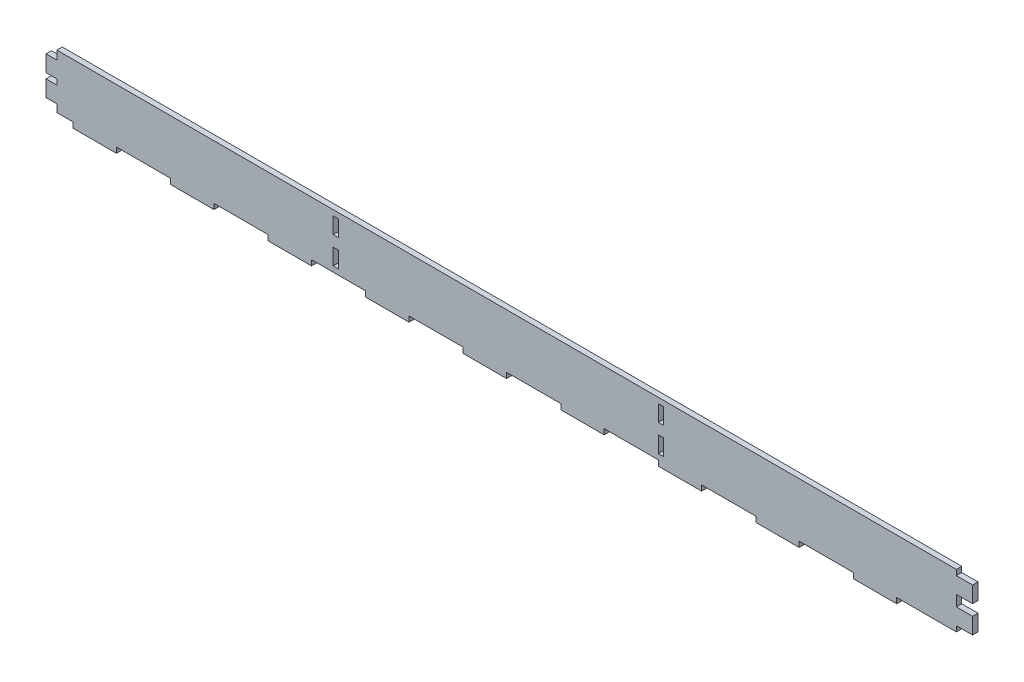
ISO-10303-21;
HEADER;
FILE_DESCRIPTION(('STEP AP214'),'2;1');
FILE_NAME('part.step','',(''),(''),'','','');
FILE_SCHEMA(('AUTOMOTIVE_DESIGN { 1 0 10303 214 1 1 1 1 }'));
ENDSEC;
DATA;
#1=APPLICATION_CONTEXT('core data for automotive mechanical design processes');
#2=APPLICATION_PROTOCOL_DEFINITION('international standard','automotive_design',2000,#1);
#3=PRODUCT_CONTEXT('',#1,'mechanical');
#4=PRODUCT('Part','Part','',(#3));
#5=PRODUCT_RELATED_PRODUCT_CATEGORY('part','',(#4));
#6=PRODUCT_DEFINITION_FORMATION('','',#4);
#7=PRODUCT_DEFINITION_CONTEXT('part definition',#1,'design');
#8=PRODUCT_DEFINITION('design','',#6,#7);
#9=PRODUCT_DEFINITION_SHAPE('','',#8);
#10=(LENGTH_UNIT() NAMED_UNIT(*) SI_UNIT(.MILLI.,.METRE.));
#11=(NAMED_UNIT(*) PLANE_ANGLE_UNIT() SI_UNIT($,.RADIAN.));
#12=(NAMED_UNIT(*) SI_UNIT($,.STERADIAN.) SOLID_ANGLE_UNIT());
#13=UNCERTAINTY_MEASURE_WITH_UNIT(LENGTH_MEASURE(1.E-05),#10,'distance_accuracy_value','');
#14=(GEOMETRIC_REPRESENTATION_CONTEXT(3) GLOBAL_UNCERTAINTY_ASSIGNED_CONTEXT((#13)) GLOBAL_UNIT_ASSIGNED_CONTEXT((#10,
#11,#12)) REPRESENTATION_CONTEXT('',''));
#15=CARTESIAN_POINT('',(0.,0.,0.));
#16=DIRECTION('',(0.,0.,1.));
#17=DIRECTION('',(1.,0.,0.));
#18=AXIS2_PLACEMENT_3D('',#15,#16,#17);
#19=CARTESIAN_POINT('',(0.,0.,5.));
#20=DIRECTION('',(0.,0.,1.));
#21=DIRECTION('',(1.,0.,0.));
#22=AXIS2_PLACEMENT_3D('',#19,#20,#21);
#23=PLANE('',#22);
#24=DIRECTION('',(0.,1.,0.));
#25=VECTOR('',#24,1.);
#26=CARTESIAN_POINT('',(55.,50.,5.));
#27=LINE('',#26,#25);
#28=CARTESIAN_POINT('',(55.,42.,5.));
#29=VERTEX_POINT('',#28);
#30=CARTESIAN_POINT('',(55.,50.,5.));
#31=VERTEX_POINT('',#30);
#32=EDGE_CURVE('E58',#29,#31,#27,.T.);
#33=ORIENTED_EDGE('',*,*,#32,.F.);
#34=DIRECTION('',(1.,0.,0.));
#35=VECTOR('',#34,1.);
#36=CARTESIAN_POINT('',(55.,42.,5.));
#37=LINE('',#36,#35);
#38=CARTESIAN_POINT('',(45.,42.,5.));
#39=VERTEX_POINT('',#38);
#40=EDGE_CURVE('E2105',#39,#29,#37,.T.);
#41=ORIENTED_EDGE('',*,*,#40,.F.);
#42=DIRECTION('',(0.,1.,0.));
#43=VECTOR('',#42,1.);
#44=CARTESIAN_POINT('',(45.,42.,5.));
#45=LINE('',#44,#43);
#46=CARTESIAN_POINT('',(45.,27.,5.));
#47=VERTEX_POINT('',#46);
#48=EDGE_CURVE('E2102',#47,#39,#45,.T.);
#49=ORIENTED_EDGE('',*,*,#48,.F.);
#50=DIRECTION('',(-1.,0.,0.));
#51=VECTOR('',#50,1.);
#52=CARTESIAN_POINT('',(45.,27.,5.));
#53=LINE('',#52,#51);
#54=CARTESIAN_POINT('',(55.,27.,5.));
#55=VERTEX_POINT('',#54);
#56=EDGE_CURVE('E2098',#55,#47,#53,.T.);
#57=ORIENTED_EDGE('',*,*,#56,.F.);
#58=DIRECTION('',(0.,1.,0.));
#59=VECTOR('',#58,1.);
#60=CARTESIAN_POINT('',(55.,27.,5.));
#61=LINE('',#60,#59);
#62=CARTESIAN_POINT('',(55.,22.,5.));
#63=VERTEX_POINT('',#62);
#64=EDGE_CURVE('E2091',#63,#55,#61,.T.);
#65=ORIENTED_EDGE('',*,*,#64,.F.);
#66=DIRECTION('',(1.,0.,0.));
#67=VECTOR('',#66,1.);
#68=CARTESIAN_POINT('',(55.,22.,5.));
#69=LINE('',#68,#67);
#70=CARTESIAN_POINT('',(45.,22.,5.));
#71=VERTEX_POINT('',#70);
#72=EDGE_CURVE('E2087',#71,#63,#69,.T.);
#73=ORIENTED_EDGE('',*,*,#72,.F.);
#74=DIRECTION('',(0.,1.,0.));
#75=VECTOR('',#74,1.);
#76=CARTESIAN_POINT('',(45.,22.,5.));
#77=LINE('',#76,#75);
#78=CARTESIAN_POINT('',(45.,7.00000000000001,5.));
#79=VERTEX_POINT('',#78);
#80=EDGE_CURVE('E2080',#79,#71,#77,.T.);
#81=ORIENTED_EDGE('',*,*,#80,.F.);
#82=DIRECTION('',(-1.,0.,0.));
#83=VECTOR('',#82,1.);
#84=CARTESIAN_POINT('',(45.,7.00000000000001,5.));
#85=LINE('',#84,#83);
#86=CARTESIAN_POINT('',(55.,7.00000000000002,5.));
#87=VERTEX_POINT('',#86);
#88=EDGE_CURVE('E2076',#87,#79,#85,.T.);
#89=ORIENTED_EDGE('',*,*,#88,.F.);
#90=DIRECTION('',(0.,1.,0.));
#91=VECTOR('',#90,1.);
#92=CARTESIAN_POINT('',(55.,7.00000000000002,5.));
#93=LINE('',#92,#91);
#94=CARTESIAN_POINT('',(55.,0.,5.));
#95=VERTEX_POINT('',#94);
#96=EDGE_CURVE('E2081',#95,#87,#93,.T.);
#97=ORIENTED_EDGE('',*,*,#96,.F.);
#98=DIRECTION('',(1.,0.,0.));
#99=VECTOR('',#98,1.);
#100=CARTESIAN_POINT('',(20.,0.,5.));
#101=LINE('',#100,#99);
#102=CARTESIAN_POINT('',(70.,0.,5.));
#103=VERTEX_POINT('',#102);
#104=EDGE_CURVE('E509',#95,#103,#101,.T.);
#105=ORIENTED_EDGE('',*,*,#104,.T.);
#106=DIRECTION('',(0.,-1.,0.));
#107=VECTOR('',#106,1.);
#108=CARTESIAN_POINT('',(70.,0.,5.));
#109=LINE('',#108,#107);
#110=CARTESIAN_POINT('',(70.,-5.,5.));
#111=VERTEX_POINT('',#110);
#112=EDGE_CURVE('E1203',#103,#111,#109,.T.);
#113=ORIENTED_EDGE('',*,*,#112,.T.);
#114=DIRECTION('',(1.,0.,0.));
#115=VECTOR('',#114,1.);
#116=CARTESIAN_POINT('',(70.,-5.,5.));
#117=LINE('',#116,#115);
#118=CARTESIAN_POINT('',(110.,-5.,5.));
#119=VERTEX_POINT('',#118);
#120=EDGE_CURVE('E850',#111,#119,#117,.T.);
#121=ORIENTED_EDGE('',*,*,#120,.T.);
#122=DIRECTION('',(0.,1.,0.));
#123=VECTOR('',#122,1.);
#124=CARTESIAN_POINT('',(110.,-5.,5.));
#125=LINE('',#124,#123);
#126=CARTESIAN_POINT('',(110.,0.,5.));
#127=VERTEX_POINT('',#126);
#128=EDGE_CURVE('E869',#119,#127,#125,.T.);
#129=ORIENTED_EDGE('',*,*,#128,.T.);
#130=DIRECTION('',(1.,0.,0.));
#131=VECTOR('',#130,1.);
#132=CARTESIAN_POINT('',(110.,0.,5.));
#133=LINE('',#132,#131);
#134=CARTESIAN_POINT('',(160.,0.,5.));
#135=VERTEX_POINT('',#134);
#136=EDGE_CURVE('E864',#127,#135,#133,.T.);
#137=ORIENTED_EDGE('',*,*,#136,.T.);
#138=DIRECTION('',(0.,-1.,0.));
#139=VECTOR('',#138,1.);
#140=CARTESIAN_POINT('',(160.,0.,5.));
#141=LINE('',#140,#139);
#142=CARTESIAN_POINT('',(160.,-5.,5.));
#143=VERTEX_POINT('',#142);
#144=EDGE_CURVE('E868',#135,#143,#141,.T.);
#145=ORIENTED_EDGE('',*,*,#144,.T.);
#146=DIRECTION('',(1.,0.,0.));
#147=VECTOR('',#146,1.);
#148=CARTESIAN_POINT('',(160.,-5.,5.));
#149=LINE('',#148,#147);
#150=CARTESIAN_POINT('',(200.,-5.,5.));
#151=VERTEX_POINT('',#150);
#152=EDGE_CURVE('E873',#143,#151,#149,.T.);
#153=ORIENTED_EDGE('',*,*,#152,.T.);
#154=DIRECTION('',(0.,1.,0.));
#155=VECTOR('',#154,1.);
#156=CARTESIAN_POINT('',(200.,-5.,5.));
#157=LINE('',#156,#155);
#158=CARTESIAN_POINT('',(200.,0.,5.));
#159=VERTEX_POINT('',#158);
#160=EDGE_CURVE('E880',#151,#159,#157,.T.);
#161=ORIENTED_EDGE('',*,*,#160,.T.);
#162=DIRECTION('',(1.,0.,0.));
#163=VECTOR('',#162,1.);
#164=CARTESIAN_POINT('',(200.,0.,5.));
#165=LINE('',#164,#163);
#166=CARTESIAN_POINT('',(250.,0.,5.));
#167=VERTEX_POINT('',#166);
#168=EDGE_CURVE('E883',#159,#167,#165,.T.);
#169=ORIENTED_EDGE('',*,*,#168,.T.);
#170=DIRECTION('',(0.,-1.,0.));
#171=VECTOR('',#170,1.);
#172=CARTESIAN_POINT('',(250.,0.,5.));
#173=LINE('',#172,#171);
#174=CARTESIAN_POINT('',(250.,-5.,5.));
#175=VERTEX_POINT('',#174);
#176=EDGE_CURVE('E886',#167,#175,#173,.T.);
#177=ORIENTED_EDGE('',*,*,#176,.T.);
#178=DIRECTION('',(1.,0.,0.));
#179=VECTOR('',#178,1.);
#180=CARTESIAN_POINT('',(250.,-5.,5.));
#181=LINE('',#180,#179);
#182=CARTESIAN_POINT('',(290.,-5.,5.));
#183=VERTEX_POINT('',#182);
#184=EDGE_CURVE('E889',#175,#183,#181,.T.);
#185=ORIENTED_EDGE('',*,*,#184,.T.);
#186=DIRECTION('',(0.,1.,0.));
#187=VECTOR('',#186,1.);
#188=CARTESIAN_POINT('',(290.,-5.,5.));
#189=LINE('',#188,#187);
#190=CARTESIAN_POINT('',(290.,0.,5.));
#191=VERTEX_POINT('',#190);
#192=EDGE_CURVE('E892',#183,#191,#189,.T.);
#193=ORIENTED_EDGE('',*,*,#192,.T.);
#194=DIRECTION('',(1.,0.,0.));
#195=VECTOR('',#194,1.);
#196=CARTESIAN_POINT('',(290.,0.,5.));
#197=LINE('',#196,#195);
#198=CARTESIAN_POINT('',(340.,0.,5.));
#199=VERTEX_POINT('',#198);
#200=EDGE_CURVE('E895',#191,#199,#197,.T.);
#201=ORIENTED_EDGE('',*,*,#200,.T.);
#202=DIRECTION('',(0.,-1.,0.));
#203=VECTOR('',#202,1.);
#204=CARTESIAN_POINT('',(340.,0.,5.));
#205=LINE('',#204,#203);
#206=CARTESIAN_POINT('',(340.,-5.,5.));
#207=VERTEX_POINT('',#206);
#208=EDGE_CURVE('E898',#199,#207,#205,.T.);
#209=ORIENTED_EDGE('',*,*,#208,.T.);
#210=DIRECTION('',(1.,0.,0.));
#211=VECTOR('',#210,1.);
#212=CARTESIAN_POINT('',(340.,-5.,5.));
#213=LINE('',#212,#211);
#214=CARTESIAN_POINT('',(380.,-5.,5.));
#215=VERTEX_POINT('',#214);
#216=EDGE_CURVE('E901',#207,#215,#213,.T.);
#217=ORIENTED_EDGE('',*,*,#216,.T.);
#218=DIRECTION('',(0.,1.,0.));
#219=VECTOR('',#218,1.);
#220=CARTESIAN_POINT('',(380.,-5.,5.));
#221=LINE('',#220,#219);
#222=CARTESIAN_POINT('',(380.,0.,5.));
#223=VERTEX_POINT('',#222);
#224=EDGE_CURVE('E904',#215,#223,#221,.T.);
#225=ORIENTED_EDGE('',*,*,#224,.T.);
#226=DIRECTION('',(1.,0.,0.));
#227=VECTOR('',#226,1.);
#228=CARTESIAN_POINT('',(380.,0.,5.));
#229=LINE('',#228,#227);
#230=CARTESIAN_POINT('',(430.,0.,5.));
#231=VERTEX_POINT('',#230);
#232=EDGE_CURVE('E907',#223,#231,#229,.T.);
#233=ORIENTED_EDGE('',*,*,#232,.T.);
#234=DIRECTION('',(0.,-1.,0.));
#235=VECTOR('',#234,1.);
#236=CARTESIAN_POINT('',(430.,0.,5.));
#237=LINE('',#236,#235);
#238=CARTESIAN_POINT('',(430.,-5.,5.));
#239=VERTEX_POINT('',#238);
#240=EDGE_CURVE('E910',#231,#239,#237,.T.);
#241=ORIENTED_EDGE('',*,*,#240,.T.);
#242=DIRECTION('',(1.,0.,0.));
#243=VECTOR('',#242,1.);
#244=CARTESIAN_POINT('',(430.,-5.,5.));
#245=LINE('',#244,#243);
#246=CARTESIAN_POINT('',(470.,-5.,5.));
#247=VERTEX_POINT('',#246);
#248=EDGE_CURVE('E913',#239,#247,#245,.T.);
#249=ORIENTED_EDGE('',*,*,#248,.T.);
#250=DIRECTION('',(0.,1.,0.));
#251=VECTOR('',#250,1.);
#252=CARTESIAN_POINT('',(470.,-5.,5.));
#253=LINE('',#252,#251);
#254=CARTESIAN_POINT('',(470.,0.,5.));
#255=VERTEX_POINT('',#254);
#256=EDGE_CURVE('E916',#247,#255,#253,.T.);
#257=ORIENTED_EDGE('',*,*,#256,.T.);
#258=DIRECTION('',(1.,0.,0.));
#259=VECTOR('',#258,1.);
#260=CARTESIAN_POINT('',(470.,0.,5.));
#261=LINE('',#260,#259);
#262=CARTESIAN_POINT('',(520.,0.,5.));
#263=VERTEX_POINT('',#262);
#264=EDGE_CURVE('E919',#255,#263,#261,.T.);
#265=ORIENTED_EDGE('',*,*,#264,.T.);
#266=DIRECTION('',(0.,-1.,0.));
#267=VECTOR('',#266,1.);
#268=CARTESIAN_POINT('',(520.,0.,5.));
#269=LINE('',#268,#267);
#270=CARTESIAN_POINT('',(520.,-5.,5.));
#271=VERTEX_POINT('',#270);
#272=EDGE_CURVE('E922',#263,#271,#269,.T.);
#273=ORIENTED_EDGE('',*,*,#272,.T.);
#274=DIRECTION('',(1.,0.,0.));
#275=VECTOR('',#274,1.);
#276=CARTESIAN_POINT('',(520.,-5.,5.));
#277=LINE('',#276,#275);
#278=CARTESIAN_POINT('',(560.,-5.,5.));
#279=VERTEX_POINT('',#278);
#280=EDGE_CURVE('E925',#271,#279,#277,.T.);
#281=ORIENTED_EDGE('',*,*,#280,.T.);
#282=DIRECTION('',(0.,1.,0.));
#283=VECTOR('',#282,1.);
#284=CARTESIAN_POINT('',(560.,-5.,5.));
#285=LINE('',#284,#283);
#286=CARTESIAN_POINT('',(560.,0.,5.));
#287=VERTEX_POINT('',#286);
#288=EDGE_CURVE('E928',#279,#287,#285,.T.);
#289=ORIENTED_EDGE('',*,*,#288,.T.);
#290=DIRECTION('',(1.,0.,0.));
#291=VECTOR('',#290,1.);
#292=CARTESIAN_POINT('',(560.,0.,5.));
#293=LINE('',#292,#291);
#294=CARTESIAN_POINT('',(610.,0.,5.));
#295=VERTEX_POINT('',#294);
#296=EDGE_CURVE('E931',#287,#295,#293,.T.);
#297=ORIENTED_EDGE('',*,*,#296,.T.);
#298=DIRECTION('',(0.,-1.,0.));
#299=VECTOR('',#298,1.);
#300=CARTESIAN_POINT('',(610.,0.,5.));
#301=LINE('',#300,#299);
#302=CARTESIAN_POINT('',(610.,-5.,5.));
#303=VERTEX_POINT('',#302);
#304=EDGE_CURVE('E934',#295,#303,#301,.T.);
#305=ORIENTED_EDGE('',*,*,#304,.T.);
#306=DIRECTION('',(1.,0.,0.));
#307=VECTOR('',#306,1.);
#308=CARTESIAN_POINT('',(610.,-5.,5.));
#309=LINE('',#308,#307);
#310=CARTESIAN_POINT('',(650.,-5.,5.));
#311=VERTEX_POINT('',#310);
#312=EDGE_CURVE('E937',#303,#311,#309,.T.);
#313=ORIENTED_EDGE('',*,*,#312,.T.);
#314=DIRECTION('',(0.,1.,0.));
#315=VECTOR('',#314,1.);
#316=CARTESIAN_POINT('',(650.,-5.,5.));
#317=LINE('',#316,#315);
#318=CARTESIAN_POINT('',(650.,0.,5.));
#319=VERTEX_POINT('',#318);
#320=EDGE_CURVE('E940',#311,#319,#317,.T.);
#321=ORIENTED_EDGE('',*,*,#320,.T.);
#322=DIRECTION('',(1.,0.,0.));
#323=VECTOR('',#322,1.);
#324=CARTESIAN_POINT('',(650.,0.,5.));
#325=LINE('',#324,#323);
#326=CARTESIAN_POINT('',(700.,0.,5.));
#327=VERTEX_POINT('',#326);
#328=EDGE_CURVE('E943',#319,#327,#325,.T.);
#329=ORIENTED_EDGE('',*,*,#328,.T.);
#330=DIRECTION('',(0.,-1.,0.));
#331=VECTOR('',#330,1.);
#332=CARTESIAN_POINT('',(700.,0.,5.));
#333=LINE('',#332,#331);
#334=CARTESIAN_POINT('',(700.,-5.,5.));
#335=VERTEX_POINT('',#334);
#336=EDGE_CURVE('E946',#327,#335,#333,.T.);
#337=ORIENTED_EDGE('',*,*,#336,.T.);
#338=DIRECTION('',(1.,0.,0.));
#339=VECTOR('',#338,1.);
#340=CARTESIAN_POINT('',(700.,-5.,5.));
#341=LINE('',#340,#339);
#342=CARTESIAN_POINT('',(740.,-5.,5.));
#343=VERTEX_POINT('',#342);
#344=EDGE_CURVE('E949',#335,#343,#341,.T.);
#345=ORIENTED_EDGE('',*,*,#344,.T.);
#346=DIRECTION('',(0.,1.,0.));
#347=VECTOR('',#346,1.);
#348=CARTESIAN_POINT('',(740.,-5.,5.));
#349=LINE('',#348,#347);
#350=CARTESIAN_POINT('',(740.,0.,5.));
#351=VERTEX_POINT('',#350);
#352=EDGE_CURVE('E952',#343,#351,#349,.T.);
#353=ORIENTED_EDGE('',*,*,#352,.T.);
#354=DIRECTION('',(1.,0.,0.));
#355=VECTOR('',#354,1.);
#356=CARTESIAN_POINT('',(740.,0.,5.));
#357=LINE('',#356,#355);
#358=CARTESIAN_POINT('',(790.,0.,5.));
#359=VERTEX_POINT('',#358);
#360=EDGE_CURVE('E955',#351,#359,#357,.T.);
#361=ORIENTED_EDGE('',*,*,#360,.T.);
#362=DIRECTION('',(0.,-1.,0.));
#363=VECTOR('',#362,1.);
#364=CARTESIAN_POINT('',(790.,0.,5.));
#365=LINE('',#364,#363);
#366=CARTESIAN_POINT('',(790.,-5.,5.));
#367=VERTEX_POINT('',#366);
#368=EDGE_CURVE('E958',#359,#367,#365,.T.);
#369=ORIENTED_EDGE('',*,*,#368,.T.);
#370=DIRECTION('',(1.,0.,0.));
#371=VECTOR('',#370,1.);
#372=CARTESIAN_POINT('',(790.,-5.,5.));
#373=LINE('',#372,#371);
#374=CARTESIAN_POINT('',(830.,-5.,5.));
#375=VERTEX_POINT('',#374);
#376=EDGE_CURVE('E961',#367,#375,#373,.T.);
#377=ORIENTED_EDGE('',*,*,#376,.T.);
#378=DIRECTION('',(0.,1.,0.));
#379=VECTOR('',#378,1.);
#380=CARTESIAN_POINT('',(830.,-5.,5.));
#381=LINE('',#380,#379);
#382=CARTESIAN_POINT('',(830.,0.,5.));
#383=VERTEX_POINT('',#382);
#384=EDGE_CURVE('E964',#375,#383,#381,.T.);
#385=ORIENTED_EDGE('',*,*,#384,.T.);
#386=DIRECTION('',(1.,0.,0.));
#387=VECTOR('',#386,1.);
#388=CARTESIAN_POINT('',(830.,0.,5.));
#389=LINE('',#388,#387);
#390=CARTESIAN_POINT('',(885.,0.,5.));
#391=VERTEX_POINT('',#390);
#392=EDGE_CURVE('E967',#383,#391,#389,.T.);
#393=ORIENTED_EDGE('',*,*,#392,.T.);
#394=DIRECTION('',(0.,1.,0.));
#395=VECTOR('',#394,1.);
#396=CARTESIAN_POINT('',(885.,0.,5.));
#397=LINE('',#396,#395);
#398=CARTESIAN_POINT('',(885.,5.,5.));
#399=VERTEX_POINT('',#398);
#400=EDGE_CURVE('E970',#391,#399,#397,.T.);
#401=ORIENTED_EDGE('',*,*,#400,.T.);
#402=DIRECTION('',(1.,0.,0.));
#403=VECTOR('',#402,1.);
#404=CARTESIAN_POINT('',(885.,5.,5.));
#405=LINE('',#404,#403);
#406=CARTESIAN_POINT('',(900.,5.,5.));
#407=VERTEX_POINT('',#406);
#408=EDGE_CURVE('E973',#399,#407,#405,.T.);
#409=ORIENTED_EDGE('',*,*,#408,.T.);
#410=DIRECTION('',(0.,1.,0.));
#411=VECTOR('',#410,1.);
#412=CARTESIAN_POINT('',(900.,5.,5.));
#413=LINE('',#412,#411);
#414=CARTESIAN_POINT('',(900.,20.,5.));
#415=VERTEX_POINT('',#414);
#416=EDGE_CURVE('E976',#407,#415,#413,.T.);
#417=ORIENTED_EDGE('',*,*,#416,.T.);
#418=DIRECTION('',(-1.,0.,0.));
#419=VECTOR('',#418,1.);
#420=CARTESIAN_POINT('',(900.,20.,5.));
#421=LINE('',#420,#419);
#422=CARTESIAN_POINT('',(885.,20.,5.));
#423=VERTEX_POINT('',#422);
#424=EDGE_CURVE('E979',#415,#423,#421,.T.);
#425=ORIENTED_EDGE('',*,*,#424,.T.);
#426=DIRECTION('',(0.,1.,0.));
#427=VECTOR('',#426,1.);
#428=CARTESIAN_POINT('',(885.,20.,5.));
#429=LINE('',#428,#427);
#430=CARTESIAN_POINT('',(885.,30.,5.));
#431=VERTEX_POINT('',#430);
#432=EDGE_CURVE('E982',#423,#431,#429,.T.);
#433=ORIENTED_EDGE('',*,*,#432,.T.);
#434=DIRECTION('',(1.,0.,0.));
#435=VECTOR('',#434,1.);
#436=CARTESIAN_POINT('',(885.,30.,5.));
#437=LINE('',#436,#435);
#438=CARTESIAN_POINT('',(900.,30.,5.));
#439=VERTEX_POINT('',#438);
#440=EDGE_CURVE('E985',#431,#439,#437,.T.);
#441=ORIENTED_EDGE('',*,*,#440,.T.);
#442=DIRECTION('',(0.,1.,0.));
#443=VECTOR('',#442,1.);
#444=CARTESIAN_POINT('',(900.,30.,5.));
#445=LINE('',#444,#443);
#446=CARTESIAN_POINT('',(900.,45.,5.));
#447=VERTEX_POINT('',#446);
#448=EDGE_CURVE('E988',#439,#447,#445,.T.);
#449=ORIENTED_EDGE('',*,*,#448,.T.);
#450=DIRECTION('',(-1.,0.,0.));
#451=VECTOR('',#450,1.);
#452=CARTESIAN_POINT('',(900.,45.,5.));
#453=LINE('',#452,#451);
#454=CARTESIAN_POINT('',(885.,45.,5.));
#455=VERTEX_POINT('',#454);
#456=EDGE_CURVE('E991',#447,#455,#453,.T.);
#457=ORIENTED_EDGE('',*,*,#456,.T.);
#458=DIRECTION('',(0.,1.,0.));
#459=VECTOR('',#458,1.);
#460=CARTESIAN_POINT('',(885.,45.,5.));
#461=LINE('',#460,#459);
#462=CARTESIAN_POINT('',(885.,50.,5.));
#463=VERTEX_POINT('',#462);
#464=EDGE_CURVE('E993',#455,#463,#461,.T.);
#465=ORIENTED_EDGE('',*,*,#464,.T.);
#466=DIRECTION('',(-1.,0.,0.));
#467=VECTOR('',#466,1.);
#468=CARTESIAN_POINT('',(885.,50.,5.));
#469=LINE('',#468,#467);
#470=EDGE_CURVE('E530',#463,#31,#469,.T.);
#471=ORIENTED_EDGE('',*,*,#470,.T.);
#472=EDGE_LOOP('',(#33,#41,#49,#57,#65,#73,#81,#89,#97,#105,#113,#121,#129,#137,#145,#153,#161,
#169,#177,#185,#193,#201,#209,#217,#225,#233,#241,#249,#257,#265,#273,#281,#289,#297,#305,#313,
#321,#329,#337,#345,#353,#361,#369,#377,#385,#393,#401,#409,#417,#425,#433,#441,#449,#457,#465,#471));
#473=FACE_BOUND('',#472,.T.);
#474=DIRECTION('',(0.,-1.,0.));
#475=VECTOR('',#474,1.);
#476=CARTESIAN_POINT('',(610.,20.,5.));
#477=LINE('',#476,#475);
#478=CARTESIAN_POINT('',(610.,20.,5.));
#479=VERTEX_POINT('',#478);
#480=CARTESIAN_POINT('',(610.,5.,5.));
#481=VERTEX_POINT('',#480);
#482=EDGE_CURVE('E1167',#479,#481,#477,.T.);
#483=ORIENTED_EDGE('',*,*,#482,.F.);
#484=DIRECTION('',(-1.,0.,0.));
#485=VECTOR('',#484,1.);
#486=CARTESIAN_POINT('',(615.,20.,5.));
#487=LINE('',#486,#485);
#488=CARTESIAN_POINT('',(615.,20.,5.));
#489=VERTEX_POINT('',#488);
#490=EDGE_CURVE('E1164',#489,#479,#487,.T.);
#491=ORIENTED_EDGE('',*,*,#490,.F.);
#492=DIRECTION('',(0.,1.,0.));
#493=VECTOR('',#492,1.);
#494=CARTESIAN_POINT('',(615.,5.,5.));
#495=LINE('',#494,#493);
#496=CARTESIAN_POINT('',(615.,5.,5.));
#497=VERTEX_POINT('',#496);
#498=EDGE_CURVE('E1175',#497,#489,#495,.T.);
#499=ORIENTED_EDGE('',*,*,#498,.F.);
#500=DIRECTION('',(1.,0.,0.));
#501=VECTOR('',#500,1.);
#502=CARTESIAN_POINT('',(610.,5.,5.));
#503=LINE('',#502,#501);
#504=EDGE_CURVE('E1171',#481,#497,#503,.T.);
#505=ORIENTED_EDGE('',*,*,#504,.F.);
#506=EDGE_LOOP('',(#483,#491,#499,#505));
#507=FACE_BOUND('',#506,.T.);
#508=DIRECTION('',(0.,-1.,0.));
#509=VECTOR('',#508,1.);
#510=CARTESIAN_POINT('',(610.,45.,5.));
#511=LINE('',#510,#509);
#512=CARTESIAN_POINT('',(610.,45.,5.));
#513=VERTEX_POINT('',#512);
#514=CARTESIAN_POINT('',(610.,30.,5.));
#515=VERTEX_POINT('',#514);
#516=EDGE_CURVE('E1124',#513,#515,#511,.T.);
#517=ORIENTED_EDGE('',*,*,#516,.F.);
#518=DIRECTION('',(-1.,0.,0.));
#519=VECTOR('',#518,1.);
#520=CARTESIAN_POINT('',(615.,45.,5.));
#521=LINE('',#520,#519);
#522=CARTESIAN_POINT('',(615.,45.,5.));
#523=VERTEX_POINT('',#522);
#524=EDGE_CURVE('E1121',#523,#513,#521,.T.);
#525=ORIENTED_EDGE('',*,*,#524,.F.);
#526=DIRECTION('',(0.,1.,0.));
#527=VECTOR('',#526,1.);
#528=CARTESIAN_POINT('',(615.,30.,5.));
#529=LINE('',#528,#527);
#530=CARTESIAN_POINT('',(615.,30.,5.));
#531=VERTEX_POINT('',#530);
#532=EDGE_CURVE('E1132',#531,#523,#529,.T.);
#533=ORIENTED_EDGE('',*,*,#532,.F.);
#534=DIRECTION('',(1.,0.,0.));
#535=VECTOR('',#534,1.);
#536=CARTESIAN_POINT('',(610.,30.,5.));
#537=LINE('',#536,#535);
#538=EDGE_CURVE('E1128',#515,#531,#537,.T.);
#539=ORIENTED_EDGE('',*,*,#538,.F.);
#540=EDGE_LOOP('',(#517,#525,#533,#539));
#541=FACE_BOUND('',#540,.T.);
#542=DIRECTION('',(0.,-1.,0.));
#543=VECTOR('',#542,1.);
#544=CARTESIAN_POINT('',(310.,20.,5.));
#545=LINE('',#544,#543);
#546=CARTESIAN_POINT('',(310.,20.,5.));
#547=VERTEX_POINT('',#546);
#548=CARTESIAN_POINT('',(310.,5.,5.));
#549=VERTEX_POINT('',#548);
#550=EDGE_CURVE('E1081',#547,#549,#545,.T.);
#551=ORIENTED_EDGE('',*,*,#550,.F.);
#552=DIRECTION('',(-1.,0.,0.));
#553=VECTOR('',#552,1.);
#554=CARTESIAN_POINT('',(315.,20.,5.));
#555=LINE('',#554,#553);
#556=CARTESIAN_POINT('',(315.,20.,5.));
#557=VERTEX_POINT('',#556);
#558=EDGE_CURVE('E1078',#557,#547,#555,.T.);
#559=ORIENTED_EDGE('',*,*,#558,.F.);
#560=DIRECTION('',(0.,1.,0.));
#561=VECTOR('',#560,1.);
#562=CARTESIAN_POINT('',(315.,5.,5.));
#563=LINE('',#562,#561);
#564=CARTESIAN_POINT('',(315.,5.,5.));
#565=VERTEX_POINT('',#564);
#566=EDGE_CURVE('E1089',#565,#557,#563,.T.);
#567=ORIENTED_EDGE('',*,*,#566,.F.);
#568=DIRECTION('',(1.,0.,0.));
#569=VECTOR('',#568,1.);
#570=CARTESIAN_POINT('',(310.,5.,5.));
#571=LINE('',#570,#569);
#572=EDGE_CURVE('E1085',#549,#565,#571,.T.);
#573=ORIENTED_EDGE('',*,*,#572,.F.);
#574=EDGE_LOOP('',(#551,#559,#567,#573));
#575=FACE_BOUND('',#574,.T.);
#576=DIRECTION('',(0.,-1.,0.));
#577=VECTOR('',#576,1.);
#578=CARTESIAN_POINT('',(310.,45.,5.));
#579=LINE('',#578,#577);
#580=CARTESIAN_POINT('',(310.,45.,5.));
#581=VERTEX_POINT('',#580);
#582=CARTESIAN_POINT('',(310.,30.,5.));
#583=VERTEX_POINT('',#582);
#584=EDGE_CURVE('E1044',#581,#583,#579,.T.);
#585=ORIENTED_EDGE('',*,*,#584,.F.);
#586=DIRECTION('',(-1.,0.,0.));
#587=VECTOR('',#586,1.);
#588=CARTESIAN_POINT('',(315.,45.,5.));
#589=LINE('',#588,#587);
#590=CARTESIAN_POINT('',(315.,45.,5.));
#591=VERTEX_POINT('',#590);
#592=EDGE_CURVE('E1041',#591,#581,#589,.T.);
#593=ORIENTED_EDGE('',*,*,#592,.F.);
#594=DIRECTION('',(0.,1.,0.));
#595=VECTOR('',#594,1.);
#596=CARTESIAN_POINT('',(315.,30.,5.));
#597=LINE('',#596,#595);
#598=CARTESIAN_POINT('',(315.,30.,5.));
#599=VERTEX_POINT('',#598);
#600=EDGE_CURVE('E1051',#599,#591,#597,.T.);
#601=ORIENTED_EDGE('',*,*,#600,.F.);
#602=DIRECTION('',(1.,0.,0.));
#603=VECTOR('',#602,1.);
#604=CARTESIAN_POINT('',(310.,30.,5.));
#605=LINE('',#604,#603);
#606=EDGE_CURVE('E1048',#583,#599,#605,.T.);
#607=ORIENTED_EDGE('',*,*,#606,.F.);
#608=EDGE_LOOP('',(#585,#593,#601,#607));
#609=FACE_BOUND('',#608,.T.);
#610=ADVANCED_FACE('F42',(#473,#507,#541,#575,#609),#23,.T.);
#611=CARTESIAN_POINT('',(0.,0.,0.));
#612=DIRECTION('',(0.,0.,1.));
#613=DIRECTION('',(1.,0.,0.));
#614=AXIS2_PLACEMENT_3D('',#611,#612,#613);
#615=PLANE('',#614);
#616=DIRECTION('',(-1.,0.,0.));
#617=VECTOR('',#616,1.);
#618=CARTESIAN_POINT('',(315.,20.,0.));
#619=LINE('',#618,#617);
#620=CARTESIAN_POINT('',(315.,20.,0.));
#621=VERTEX_POINT('',#620);
#622=CARTESIAN_POINT('',(310.,20.,0.));
#623=VERTEX_POINT('',#622);
#624=EDGE_CURVE('E1077',#621,#623,#619,.T.);
#625=ORIENTED_EDGE('',*,*,#624,.T.);
#626=DIRECTION('',(0.,-1.,0.));
#627=VECTOR('',#626,1.);
#628=CARTESIAN_POINT('',(310.,20.,0.));
#629=LINE('',#628,#627);
#630=CARTESIAN_POINT('',(310.,5.,0.));
#631=VERTEX_POINT('',#630);
#632=EDGE_CURVE('E1096',#623,#631,#629,.T.);
#633=ORIENTED_EDGE('',*,*,#632,.T.);
#634=DIRECTION('',(1.,0.,0.));
#635=VECTOR('',#634,1.);
#636=CARTESIAN_POINT('',(310.,5.,0.));
#637=LINE('',#636,#635);
#638=CARTESIAN_POINT('',(315.,5.,0.));
#639=VERTEX_POINT('',#638);
#640=EDGE_CURVE('E1100',#631,#639,#637,.T.);
#641=ORIENTED_EDGE('',*,*,#640,.T.);
#642=DIRECTION('',(0.,1.,0.));
#643=VECTOR('',#642,1.);
#644=CARTESIAN_POINT('',(315.,5.,0.));
#645=LINE('',#644,#643);
#646=EDGE_CURVE('E1082',#639,#621,#645,.T.);
#647=ORIENTED_EDGE('',*,*,#646,.T.);
#648=EDGE_LOOP('',(#625,#633,#641,#647));
#649=FACE_BOUND('',#648,.T.);
#650=DIRECTION('',(1.,0.,0.));
#651=VECTOR('',#650,1.);
#652=CARTESIAN_POINT('',(55.,42.,0.));
#653=LINE('',#652,#651);
#654=CARTESIAN_POINT('',(45.,42.,0.));
#655=VERTEX_POINT('',#654);
#656=CARTESIAN_POINT('',(55.,42.,0.));
#657=VERTEX_POINT('',#656);
#658=EDGE_CURVE('E2131',#655,#657,#653,.T.);
#659=ORIENTED_EDGE('',*,*,#658,.T.);
#660=DIRECTION('',(0.,1.,0.));
#661=VECTOR('',#660,1.);
#662=CARTESIAN_POINT('',(55.,50.,0.));
#663=LINE('',#662,#661);
#664=CARTESIAN_POINT('',(55.,50.,0.));
#665=VERTEX_POINT('',#664);
#666=EDGE_CURVE('E511',#657,#665,#663,.T.);
#667=ORIENTED_EDGE('',*,*,#666,.T.);
#668=DIRECTION('',(-1.,0.,0.));
#669=VECTOR('',#668,1.);
#670=CARTESIAN_POINT('',(885.,50.,0.));
#671=LINE('',#670,#669);
#672=CARTESIAN_POINT('',(885.,50.,0.));
#673=VERTEX_POINT('',#672);
#674=EDGE_CURVE('E664',#673,#665,#671,.T.);
#675=ORIENTED_EDGE('',*,*,#674,.F.);
#676=DIRECTION('',(0.,1.,0.));
#677=VECTOR('',#676,1.);
#678=CARTESIAN_POINT('',(885.,45.,0.));
#679=LINE('',#678,#677);
#680=CARTESIAN_POINT('',(885.,45.,0.));
#681=VERTEX_POINT('',#680);
#682=EDGE_CURVE('E661',#681,#673,#679,.T.);
#683=ORIENTED_EDGE('',*,*,#682,.F.);
#684=DIRECTION('',(-1.,0.,0.));
#685=VECTOR('',#684,1.);
#686=CARTESIAN_POINT('',(900.,45.,0.));
#687=LINE('',#686,#685);
#688=CARTESIAN_POINT('',(900.,45.,0.));
#689=VERTEX_POINT('',#688);
#690=EDGE_CURVE('E658',#689,#681,#687,.T.);
#691=ORIENTED_EDGE('',*,*,#690,.F.);
#692=DIRECTION('',(0.,1.,0.));
#693=VECTOR('',#692,1.);
#694=CARTESIAN_POINT('',(900.,30.,0.));
#695=LINE('',#694,#693);
#696=CARTESIAN_POINT('',(900.,30.,0.));
#697=VERTEX_POINT('',#696);
#698=EDGE_CURVE('E655',#697,#689,#695,.T.);
#699=ORIENTED_EDGE('',*,*,#698,.F.);
#700=DIRECTION('',(1.,0.,0.));
#701=VECTOR('',#700,1.);
#702=CARTESIAN_POINT('',(885.,30.,0.));
#703=LINE('',#702,#701);
#704=CARTESIAN_POINT('',(885.,30.,0.));
#705=VERTEX_POINT('',#704);
#706=EDGE_CURVE('E652',#705,#697,#703,.T.);
#707=ORIENTED_EDGE('',*,*,#706,.F.);
#708=DIRECTION('',(0.,1.,0.));
#709=VECTOR('',#708,1.);
#710=CARTESIAN_POINT('',(885.,20.,0.));
#711=LINE('',#710,#709);
#712=CARTESIAN_POINT('',(885.,20.,0.));
#713=VERTEX_POINT('',#712);
#714=EDGE_CURVE('E649',#713,#705,#711,.T.);
#715=ORIENTED_EDGE('',*,*,#714,.F.);
#716=DIRECTION('',(-1.,0.,0.));
#717=VECTOR('',#716,1.);
#718=CARTESIAN_POINT('',(900.,20.,0.));
#719=LINE('',#718,#717);
#720=CARTESIAN_POINT('',(900.,20.,0.));
#721=VERTEX_POINT('',#720);
#722=EDGE_CURVE('E646',#721,#713,#719,.T.);
#723=ORIENTED_EDGE('',*,*,#722,.F.);
#724=DIRECTION('',(0.,1.,0.));
#725=VECTOR('',#724,1.);
#726=CARTESIAN_POINT('',(900.,5.,0.));
#727=LINE('',#726,#725);
#728=CARTESIAN_POINT('',(900.,5.,0.));
#729=VERTEX_POINT('',#728);
#730=EDGE_CURVE('E643',#729,#721,#727,.T.);
#731=ORIENTED_EDGE('',*,*,#730,.F.);
#732=DIRECTION('',(1.,0.,0.));
#733=VECTOR('',#732,1.);
#734=CARTESIAN_POINT('',(885.,5.,0.));
#735=LINE('',#734,#733);
#736=CARTESIAN_POINT('',(885.,5.,0.));
#737=VERTEX_POINT('',#736);
#738=EDGE_CURVE('E640',#737,#729,#735,.T.);
#739=ORIENTED_EDGE('',*,*,#738,.F.);
#740=DIRECTION('',(0.,1.,0.));
#741=VECTOR('',#740,1.);
#742=CARTESIAN_POINT('',(885.,0.,0.));
#743=LINE('',#742,#741);
#744=CARTESIAN_POINT('',(885.,0.,0.));
#745=VERTEX_POINT('',#744);
#746=EDGE_CURVE('E637',#745,#737,#743,.T.);
#747=ORIENTED_EDGE('',*,*,#746,.F.);
#748=DIRECTION('',(1.,0.,0.));
#749=VECTOR('',#748,1.);
#750=CARTESIAN_POINT('',(830.,0.,0.));
#751=LINE('',#750,#749);
#752=CARTESIAN_POINT('',(830.,0.,0.));
#753=VERTEX_POINT('',#752);
#754=EDGE_CURVE('E634',#753,#745,#751,.T.);
#755=ORIENTED_EDGE('',*,*,#754,.F.);
#756=DIRECTION('',(0.,1.,0.));
#757=VECTOR('',#756,1.);
#758=CARTESIAN_POINT('',(830.,-5.,0.));
#759=LINE('',#758,#757);
#760=CARTESIAN_POINT('',(830.,-5.,0.));
#761=VERTEX_POINT('',#760);
#762=EDGE_CURVE('E631',#761,#753,#759,.T.);
#763=ORIENTED_EDGE('',*,*,#762,.F.);
#764=DIRECTION('',(1.,0.,0.));
#765=VECTOR('',#764,1.);
#766=CARTESIAN_POINT('',(790.,-5.,0.));
#767=LINE('',#766,#765);
#768=CARTESIAN_POINT('',(790.,-5.,0.));
#769=VERTEX_POINT('',#768);
#770=EDGE_CURVE('E628',#769,#761,#767,.T.);
#771=ORIENTED_EDGE('',*,*,#770,.F.);
#772=DIRECTION('',(0.,-1.,0.));
#773=VECTOR('',#772,1.);
#774=CARTESIAN_POINT('',(790.,0.,0.));
#775=LINE('',#774,#773);
#776=CARTESIAN_POINT('',(790.,0.,0.));
#777=VERTEX_POINT('',#776);
#778=EDGE_CURVE('E625',#777,#769,#775,.T.);
#779=ORIENTED_EDGE('',*,*,#778,.F.);
#780=DIRECTION('',(1.,0.,0.));
#781=VECTOR('',#780,1.);
#782=CARTESIAN_POINT('',(740.,0.,0.));
#783=LINE('',#782,#781);
#784=CARTESIAN_POINT('',(740.,0.,0.));
#785=VERTEX_POINT('',#784);
#786=EDGE_CURVE('E622',#785,#777,#783,.T.);
#787=ORIENTED_EDGE('',*,*,#786,.F.);
#788=DIRECTION('',(0.,1.,0.));
#789=VECTOR('',#788,1.);
#790=CARTESIAN_POINT('',(740.,-5.,0.));
#791=LINE('',#790,#789);
#792=CARTESIAN_POINT('',(740.,-5.,0.));
#793=VERTEX_POINT('',#792);
#794=EDGE_CURVE('E619',#793,#785,#791,.T.);
#795=ORIENTED_EDGE('',*,*,#794,.F.);
#796=DIRECTION('',(1.,0.,0.));
#797=VECTOR('',#796,1.);
#798=CARTESIAN_POINT('',(700.,-5.,0.));
#799=LINE('',#798,#797);
#800=CARTESIAN_POINT('',(700.,-5.,0.));
#801=VERTEX_POINT('',#800);
#802=EDGE_CURVE('E616',#801,#793,#799,.T.);
#803=ORIENTED_EDGE('',*,*,#802,.F.);
#804=DIRECTION('',(0.,-1.,0.));
#805=VECTOR('',#804,1.);
#806=CARTESIAN_POINT('',(700.,0.,0.));
#807=LINE('',#806,#805);
#808=CARTESIAN_POINT('',(700.,0.,0.));
#809=VERTEX_POINT('',#808);
#810=EDGE_CURVE('E613',#809,#801,#807,.T.);
#811=ORIENTED_EDGE('',*,*,#810,.F.);
#812=DIRECTION('',(1.,0.,0.));
#813=VECTOR('',#812,1.);
#814=CARTESIAN_POINT('',(650.,0.,0.));
#815=LINE('',#814,#813);
#816=CARTESIAN_POINT('',(650.,0.,0.));
#817=VERTEX_POINT('',#816);
#818=EDGE_CURVE('E610',#817,#809,#815,.T.);
#819=ORIENTED_EDGE('',*,*,#818,.F.);
#820=DIRECTION('',(0.,1.,0.));
#821=VECTOR('',#820,1.);
#822=CARTESIAN_POINT('',(650.,-5.,0.));
#823=LINE('',#822,#821);
#824=CARTESIAN_POINT('',(650.,-5.,0.));
#825=VERTEX_POINT('',#824);
#826=EDGE_CURVE('E607',#825,#817,#823,.T.);
#827=ORIENTED_EDGE('',*,*,#826,.F.);
#828=DIRECTION('',(1.,0.,0.));
#829=VECTOR('',#828,1.);
#830=CARTESIAN_POINT('',(610.,-5.,0.));
#831=LINE('',#830,#829);
#832=CARTESIAN_POINT('',(610.,-5.,0.));
#833=VERTEX_POINT('',#832);
#834=EDGE_CURVE('E604',#833,#825,#831,.T.);
#835=ORIENTED_EDGE('',*,*,#834,.F.);
#836=DIRECTION('',(0.,-1.,0.));
#837=VECTOR('',#836,1.);
#838=CARTESIAN_POINT('',(610.,0.,0.));
#839=LINE('',#838,#837);
#840=CARTESIAN_POINT('',(610.,0.,0.));
#841=VERTEX_POINT('',#840);
#842=EDGE_CURVE('E601',#841,#833,#839,.T.);
#843=ORIENTED_EDGE('',*,*,#842,.F.);
#844=DIRECTION('',(1.,0.,0.));
#845=VECTOR('',#844,1.);
#846=CARTESIAN_POINT('',(560.,0.,0.));
#847=LINE('',#846,#845);
#848=CARTESIAN_POINT('',(560.,0.,0.));
#849=VERTEX_POINT('',#848);
#850=EDGE_CURVE('E598',#849,#841,#847,.T.);
#851=ORIENTED_EDGE('',*,*,#850,.F.);
#852=DIRECTION('',(0.,1.,0.));
#853=VECTOR('',#852,1.);
#854=CARTESIAN_POINT('',(560.,-5.,0.));
#855=LINE('',#854,#853);
#856=CARTESIAN_POINT('',(560.,-5.,0.));
#857=VERTEX_POINT('',#856);
#858=EDGE_CURVE('E595',#857,#849,#855,.T.);
#859=ORIENTED_EDGE('',*,*,#858,.F.);
#860=DIRECTION('',(1.,0.,0.));
#861=VECTOR('',#860,1.);
#862=CARTESIAN_POINT('',(520.,-5.,0.));
#863=LINE('',#862,#861);
#864=CARTESIAN_POINT('',(520.,-5.,0.));
#865=VERTEX_POINT('',#864);
#866=EDGE_CURVE('E592',#865,#857,#863,.T.);
#867=ORIENTED_EDGE('',*,*,#866,.F.);
#868=DIRECTION('',(0.,-1.,0.));
#869=VECTOR('',#868,1.);
#870=CARTESIAN_POINT('',(520.,0.,0.));
#871=LINE('',#870,#869);
#872=CARTESIAN_POINT('',(520.,0.,0.));
#873=VERTEX_POINT('',#872);
#874=EDGE_CURVE('E589',#873,#865,#871,.T.);
#875=ORIENTED_EDGE('',*,*,#874,.F.);
#876=DIRECTION('',(1.,0.,0.));
#877=VECTOR('',#876,1.);
#878=CARTESIAN_POINT('',(470.,0.,0.));
#879=LINE('',#878,#877);
#880=CARTESIAN_POINT('',(470.,0.,0.));
#881=VERTEX_POINT('',#880);
#882=EDGE_CURVE('E586',#881,#873,#879,.T.);
#883=ORIENTED_EDGE('',*,*,#882,.F.);
#884=DIRECTION('',(0.,1.,0.));
#885=VECTOR('',#884,1.);
#886=CARTESIAN_POINT('',(470.,-5.,0.));
#887=LINE('',#886,#885);
#888=CARTESIAN_POINT('',(470.,-5.,0.));
#889=VERTEX_POINT('',#888);
#890=EDGE_CURVE('E583',#889,#881,#887,.T.);
#891=ORIENTED_EDGE('',*,*,#890,.F.);
#892=DIRECTION('',(1.,0.,0.));
#893=VECTOR('',#892,1.);
#894=CARTESIAN_POINT('',(430.,-5.,0.));
#895=LINE('',#894,#893);
#896=CARTESIAN_POINT('',(430.,-5.,0.));
#897=VERTEX_POINT('',#896);
#898=EDGE_CURVE('E580',#897,#889,#895,.T.);
#899=ORIENTED_EDGE('',*,*,#898,.F.);
#900=DIRECTION('',(0.,-1.,0.));
#901=VECTOR('',#900,1.);
#902=CARTESIAN_POINT('',(430.,0.,0.));
#903=LINE('',#902,#901);
#904=CARTESIAN_POINT('',(430.,0.,0.));
#905=VERTEX_POINT('',#904);
#906=EDGE_CURVE('E577',#905,#897,#903,.T.);
#907=ORIENTED_EDGE('',*,*,#906,.F.);
#908=DIRECTION('',(1.,0.,0.));
#909=VECTOR('',#908,1.);
#910=CARTESIAN_POINT('',(380.,0.,0.));
#911=LINE('',#910,#909);
#912=CARTESIAN_POINT('',(380.,0.,0.));
#913=VERTEX_POINT('',#912);
#914=EDGE_CURVE('E574',#913,#905,#911,.T.);
#915=ORIENTED_EDGE('',*,*,#914,.F.);
#916=DIRECTION('',(0.,1.,0.));
#917=VECTOR('',#916,1.);
#918=CARTESIAN_POINT('',(380.,-5.,0.));
#919=LINE('',#918,#917);
#920=CARTESIAN_POINT('',(380.,-5.,0.));
#921=VERTEX_POINT('',#920);
#922=EDGE_CURVE('E571',#921,#913,#919,.T.);
#923=ORIENTED_EDGE('',*,*,#922,.F.);
#924=DIRECTION('',(1.,0.,0.));
#925=VECTOR('',#924,1.);
#926=CARTESIAN_POINT('',(340.,-5.,0.));
#927=LINE('',#926,#925);
#928=CARTESIAN_POINT('',(340.,-5.,0.));
#929=VERTEX_POINT('',#928);
#930=EDGE_CURVE('E568',#929,#921,#927,.T.);
#931=ORIENTED_EDGE('',*,*,#930,.F.);
#932=DIRECTION('',(0.,-1.,0.));
#933=VECTOR('',#932,1.);
#934=CARTESIAN_POINT('',(340.,0.,0.));
#935=LINE('',#934,#933);
#936=CARTESIAN_POINT('',(340.,0.,0.));
#937=VERTEX_POINT('',#936);
#938=EDGE_CURVE('E565',#937,#929,#935,.T.);
#939=ORIENTED_EDGE('',*,*,#938,.F.);
#940=DIRECTION('',(1.,0.,0.));
#941=VECTOR('',#940,1.);
#942=CARTESIAN_POINT('',(290.,0.,0.));
#943=LINE('',#942,#941);
#944=CARTESIAN_POINT('',(290.,0.,0.));
#945=VERTEX_POINT('',#944);
#946=EDGE_CURVE('E562',#945,#937,#943,.T.);
#947=ORIENTED_EDGE('',*,*,#946,.F.);
#948=DIRECTION('',(0.,1.,0.));
#949=VECTOR('',#948,1.);
#950=CARTESIAN_POINT('',(290.,-5.,0.));
#951=LINE('',#950,#949);
#952=CARTESIAN_POINT('',(290.,-5.,0.));
#953=VERTEX_POINT('',#952);
#954=EDGE_CURVE('E559',#953,#945,#951,.T.);
#955=ORIENTED_EDGE('',*,*,#954,.F.);
#956=DIRECTION('',(1.,0.,0.));
#957=VECTOR('',#956,1.);
#958=CARTESIAN_POINT('',(250.,-5.,0.));
#959=LINE('',#958,#957);
#960=CARTESIAN_POINT('',(250.,-5.,0.));
#961=VERTEX_POINT('',#960);
#962=EDGE_CURVE('E556',#961,#953,#959,.T.);
#963=ORIENTED_EDGE('',*,*,#962,.F.);
#964=DIRECTION('',(0.,-1.,0.));
#965=VECTOR('',#964,1.);
#966=CARTESIAN_POINT('',(250.,0.,0.));
#967=LINE('',#966,#965);
#968=CARTESIAN_POINT('',(250.,0.,0.));
#969=VERTEX_POINT('',#968);
#970=EDGE_CURVE('E553',#969,#961,#967,.T.);
#971=ORIENTED_EDGE('',*,*,#970,.F.);
#972=DIRECTION('',(1.,0.,0.));
#973=VECTOR('',#972,1.);
#974=CARTESIAN_POINT('',(200.,0.,0.));
#975=LINE('',#974,#973);
#976=CARTESIAN_POINT('',(200.,0.,0.));
#977=VERTEX_POINT('',#976);
#978=EDGE_CURVE('E550',#977,#969,#975,.T.);
#979=ORIENTED_EDGE('',*,*,#978,.F.);
#980=DIRECTION('',(0.,1.,0.));
#981=VECTOR('',#980,1.);
#982=CARTESIAN_POINT('',(200.,-5.,0.));
#983=LINE('',#982,#981);
#984=CARTESIAN_POINT('',(200.,-5.,0.));
#985=VERTEX_POINT('',#984);
#986=EDGE_CURVE('E547',#985,#977,#983,.T.);
#987=ORIENTED_EDGE('',*,*,#986,.F.);
#988=DIRECTION('',(1.,0.,0.));
#989=VECTOR('',#988,1.);
#990=CARTESIAN_POINT('',(160.,-5.,0.));
#991=LINE('',#990,#989);
#992=CARTESIAN_POINT('',(160.,-5.,0.));
#993=VERTEX_POINT('',#992);
#994=EDGE_CURVE('E544',#993,#985,#991,.T.);
#995=ORIENTED_EDGE('',*,*,#994,.F.);
#996=DIRECTION('',(0.,-1.,0.));
#997=VECTOR('',#996,1.);
#998=CARTESIAN_POINT('',(160.,0.,0.));
#999=LINE('',#998,#997);
#1000=CARTESIAN_POINT('',(160.,0.,0.));
#1001=VERTEX_POINT('',#1000);
#1002=EDGE_CURVE('E541',#1001,#993,#999,.T.);
#1003=ORIENTED_EDGE('',*,*,#1002,.F.);
#1004=DIRECTION('',(1.,0.,0.));
#1005=VECTOR('',#1004,1.);
#1006=CARTESIAN_POINT('',(110.,0.,0.));
#1007=LINE('',#1006,#1005);
#1008=CARTESIAN_POINT('',(110.,0.,0.));
#1009=VERTEX_POINT('',#1008);
#1010=EDGE_CURVE('E538',#1009,#1001,#1007,.T.);
#1011=ORIENTED_EDGE('',*,*,#1010,.F.);
#1012=DIRECTION('',(0.,1.,0.));
#1013=VECTOR('',#1012,1.);
#1014=CARTESIAN_POINT('',(110.,-5.,0.));
#1015=LINE('',#1014,#1013);
#1016=CARTESIAN_POINT('',(110.,-5.,0.));
#1017=VERTEX_POINT('',#1016);
#1018=EDGE_CURVE('E535',#1017,#1009,#1015,.T.);
#1019=ORIENTED_EDGE('',*,*,#1018,.F.);
#1020=DIRECTION('',(1.,0.,0.));
#1021=VECTOR('',#1020,1.);
#1022=CARTESIAN_POINT('',(70.,-5.,0.));
#1023=LINE('',#1022,#1021);
#1024=CARTESIAN_POINT('',(70.,-5.,0.));
#1025=VERTEX_POINT('',#1024);
#1026=EDGE_CURVE('E524',#1025,#1017,#1023,.T.);
#1027=ORIENTED_EDGE('',*,*,#1026,.F.);
#1028=DIRECTION('',(0.,-1.,0.));
#1029=VECTOR('',#1028,1.);
#1030=CARTESIAN_POINT('',(70.,0.,0.));
#1031=LINE('',#1030,#1029);
#1032=CARTESIAN_POINT('',(70.,0.,0.));
#1033=VERTEX_POINT('',#1032);
#1034=EDGE_CURVE('E518',#1033,#1025,#1031,.T.);
#1035=ORIENTED_EDGE('',*,*,#1034,.F.);
#1036=DIRECTION('',(1.,0.,0.));
#1037=VECTOR('',#1036,1.);
#1038=CARTESIAN_POINT('',(20.,0.,0.));
#1039=LINE('',#1038,#1037);
#1040=CARTESIAN_POINT('',(55.,0.,0.));
#1041=VERTEX_POINT('',#1040);
#1042=EDGE_CURVE('E508',#1041,#1033,#1039,.T.);
#1043=ORIENTED_EDGE('',*,*,#1042,.F.);
#1044=DIRECTION('',(0.,1.,0.));
#1045=VECTOR('',#1044,1.);
#1046=CARTESIAN_POINT('',(55.,7.00000000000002,0.));
#1047=LINE('',#1046,#1045);
#1048=CARTESIAN_POINT('',(55.,7.00000000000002,0.));
#1049=VERTEX_POINT('',#1048);
#1050=EDGE_CURVE('E491',#1041,#1049,#1047,.T.);
#1051=ORIENTED_EDGE('',*,*,#1050,.T.);
#1052=DIRECTION('',(-1.,0.,0.));
#1053=VECTOR('',#1052,1.);
#1054=CARTESIAN_POINT('',(45.,7.00000000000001,0.));
#1055=LINE('',#1054,#1053);
#1056=CARTESIAN_POINT('',(45.,7.00000000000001,0.));
#1057=VERTEX_POINT('',#1056);
#1058=EDGE_CURVE('E503',#1049,#1057,#1055,.T.);
#1059=ORIENTED_EDGE('',*,*,#1058,.T.);
#1060=DIRECTION('',(0.,1.,0.));
#1061=VECTOR('',#1060,1.);
#1062=CARTESIAN_POINT('',(45.,22.,0.));
#1063=LINE('',#1062,#1061);
#1064=CARTESIAN_POINT('',(45.,22.,0.));
#1065=VERTEX_POINT('',#1064);
#1066=EDGE_CURVE('E2111',#1057,#1065,#1063,.T.);
#1067=ORIENTED_EDGE('',*,*,#1066,.T.);
#1068=DIRECTION('',(1.,0.,0.));
#1069=VECTOR('',#1068,1.);
#1070=CARTESIAN_POINT('',(55.,22.,0.));
#1071=LINE('',#1070,#1069);
#1072=CARTESIAN_POINT('',(55.,22.,0.));
#1073=VERTEX_POINT('',#1072);
#1074=EDGE_CURVE('E2115',#1065,#1073,#1071,.T.);
#1075=ORIENTED_EDGE('',*,*,#1074,.T.);
#1076=DIRECTION('',(0.,1.,0.));
#1077=VECTOR('',#1076,1.);
#1078=CARTESIAN_POINT('',(55.,27.,0.));
#1079=LINE('',#1078,#1077);
#1080=CARTESIAN_POINT('',(55.,27.,0.));
#1081=VERTEX_POINT('',#1080);
#1082=EDGE_CURVE('E2119',#1073,#1081,#1079,.T.);
#1083=ORIENTED_EDGE('',*,*,#1082,.T.);
#1084=DIRECTION('',(-1.,0.,0.));
#1085=VECTOR('',#1084,1.);
#1086=CARTESIAN_POINT('',(45.,27.,0.));
#1087=LINE('',#1086,#1085);
#1088=CARTESIAN_POINT('',(45.,27.,0.));
#1089=VERTEX_POINT('',#1088);
#1090=EDGE_CURVE('E2123',#1081,#1089,#1087,.T.);
#1091=ORIENTED_EDGE('',*,*,#1090,.T.);
#1092=DIRECTION('',(0.,1.,0.));
#1093=VECTOR('',#1092,1.);
#1094=CARTESIAN_POINT('',(45.,42.,0.));
#1095=LINE('',#1094,#1093);
#1096=EDGE_CURVE('E2127',#1089,#655,#1095,.T.);
#1097=ORIENTED_EDGE('',*,*,#1096,.T.);
#1098=EDGE_LOOP('',(#659,#667,#675,#683,#691,#699,#707,#715,#723,#731,#739,#747,#755,#763,#771,
#779,#787,#795,#803,#811,#819,#827,#835,#843,#851,#859,#867,#875,#883,#891,#899,#907,#915,#923,
#931,#939,#947,#955,#963,#971,#979,#987,#995,#1003,#1011,#1019,#1027,#1035,#1043,#1051,#1059,
#1067,#1075,#1083,#1091,#1097));
#1099=FACE_BOUND('',#1098,.T.);
#1100=DIRECTION('',(-1.,0.,0.));
#1101=VECTOR('',#1100,1.);
#1102=CARTESIAN_POINT('',(615.,20.,0.));
#1103=LINE('',#1102,#1101);
#1104=CARTESIAN_POINT('',(615.,20.,0.));
#1105=VERTEX_POINT('',#1104);
#1106=CARTESIAN_POINT('',(610.,20.,0.));
#1107=VERTEX_POINT('',#1106);
#1108=EDGE_CURVE('E1163',#1105,#1107,#1103,.T.);
#1109=ORIENTED_EDGE('',*,*,#1108,.T.);
#1110=DIRECTION('',(0.,-1.,0.));
#1111=VECTOR('',#1110,1.);
#1112=CARTESIAN_POINT('',(610.,20.,0.));
#1113=LINE('',#1112,#1111);
#1114=CARTESIAN_POINT('',(610.,5.,0.));
#1115=VERTEX_POINT('',#1114);
#1116=EDGE_CURVE('E1182',#1107,#1115,#1113,.T.);
#1117=ORIENTED_EDGE('',*,*,#1116,.T.);
#1118=DIRECTION('',(1.,0.,0.));
#1119=VECTOR('',#1118,1.);
#1120=CARTESIAN_POINT('',(610.,5.,0.));
#1121=LINE('',#1120,#1119);
#1122=CARTESIAN_POINT('',(615.,5.,0.));
#1123=VERTEX_POINT('',#1122);
#1124=EDGE_CURVE('E1186',#1115,#1123,#1121,.T.);
#1125=ORIENTED_EDGE('',*,*,#1124,.T.);
#1126=DIRECTION('',(0.,1.,0.));
#1127=VECTOR('',#1126,1.);
#1128=CARTESIAN_POINT('',(615.,5.,0.));
#1129=LINE('',#1128,#1127);
#1130=EDGE_CURVE('E1168',#1123,#1105,#1129,.T.);
#1131=ORIENTED_EDGE('',*,*,#1130,.T.);
#1132=EDGE_LOOP('',(#1109,#1117,#1125,#1131));
#1133=FACE_BOUND('',#1132,.T.);
#1134=DIRECTION('',(-1.,0.,0.));
#1135=VECTOR('',#1134,1.);
#1136=CARTESIAN_POINT('',(615.,45.,0.));
#1137=LINE('',#1136,#1135);
#1138=CARTESIAN_POINT('',(615.,45.,0.));
#1139=VERTEX_POINT('',#1138);
#1140=CARTESIAN_POINT('',(610.,45.,0.));
#1141=VERTEX_POINT('',#1140);
#1142=EDGE_CURVE('E1120',#1139,#1141,#1137,.T.);
#1143=ORIENTED_EDGE('',*,*,#1142,.T.);
#1144=DIRECTION('',(0.,-1.,0.));
#1145=VECTOR('',#1144,1.);
#1146=CARTESIAN_POINT('',(610.,45.,0.));
#1147=LINE('',#1146,#1145);
#1148=CARTESIAN_POINT('',(610.,30.,0.));
#1149=VERTEX_POINT('',#1148);
#1150=EDGE_CURVE('E1139',#1141,#1149,#1147,.T.);
#1151=ORIENTED_EDGE('',*,*,#1150,.T.);
#1152=DIRECTION('',(1.,0.,0.));
#1153=VECTOR('',#1152,1.);
#1154=CARTESIAN_POINT('',(610.,30.,0.));
#1155=LINE('',#1154,#1153);
#1156=CARTESIAN_POINT('',(615.,30.,0.));
#1157=VERTEX_POINT('',#1156);
#1158=EDGE_CURVE('E1143',#1149,#1157,#1155,.T.);
#1159=ORIENTED_EDGE('',*,*,#1158,.T.);
#1160=DIRECTION('',(0.,1.,0.));
#1161=VECTOR('',#1160,1.);
#1162=CARTESIAN_POINT('',(615.,30.,0.));
#1163=LINE('',#1162,#1161);
#1164=EDGE_CURVE('E1125',#1157,#1139,#1163,.T.);
#1165=ORIENTED_EDGE('',*,*,#1164,.T.);
#1166=EDGE_LOOP('',(#1143,#1151,#1159,#1165));
#1167=FACE_BOUND('',#1166,.T.);
#1168=DIRECTION('',(-1.,0.,0.));
#1169=VECTOR('',#1168,1.);
#1170=CARTESIAN_POINT('',(315.,45.,0.));
#1171=LINE('',#1170,#1169);
#1172=CARTESIAN_POINT('',(315.,45.,0.));
#1173=VERTEX_POINT('',#1172);
#1174=CARTESIAN_POINT('',(310.,45.,0.));
#1175=VERTEX_POINT('',#1174);
#1176=EDGE_CURVE('E1009',#1173,#1175,#1171,.T.);
#1177=ORIENTED_EDGE('',*,*,#1176,.T.);
#1178=DIRECTION('',(0.,-1.,0.));
#1179=VECTOR('',#1178,1.);
#1180=CARTESIAN_POINT('',(310.,45.,0.));
#1181=LINE('',#1180,#1179);
#1182=CARTESIAN_POINT('',(310.,30.,0.));
#1183=VERTEX_POINT('',#1182);
#1184=EDGE_CURVE('E1015',#1175,#1183,#1181,.T.);
#1185=ORIENTED_EDGE('',*,*,#1184,.T.);
#1186=DIRECTION('',(1.,0.,0.));
#1187=VECTOR('',#1186,1.);
#1188=CARTESIAN_POINT('',(310.,30.,0.));
#1189=LINE('',#1188,#1187);
#1190=CARTESIAN_POINT('',(315.,30.,0.));
#1191=VERTEX_POINT('',#1190);
#1192=EDGE_CURVE('E1058',#1183,#1191,#1189,.T.);
#1193=ORIENTED_EDGE('',*,*,#1192,.T.);
#1194=DIRECTION('',(0.,1.,0.));
#1195=VECTOR('',#1194,1.);
#1196=CARTESIAN_POINT('',(315.,30.,0.));
#1197=LINE('',#1196,#1195);
#1198=EDGE_CURVE('E1045',#1191,#1173,#1197,.T.);
#1199=ORIENTED_EDGE('',*,*,#1198,.T.);
#1200=EDGE_LOOP('',(#1177,#1185,#1193,#1199));
#1201=FACE_BOUND('',#1200,.T.);
#1202=ADVANCED_FACE('F515',(#649,#1099,#1133,#1167,#1201),#615,.F.);
#1203=CARTESIAN_POINT('',(20.,0.,5.));
#1204=DIRECTION('',(0.,1.,0.));
#1205=DIRECTION('',(0.,0.,1.));
#1206=AXIS2_PLACEMENT_3D('',#1203,#1204,#1205);
#1207=PLANE('',#1206);
#1208=ORIENTED_EDGE('',*,*,#104,.F.);
#1209=DIRECTION('',(0.,0.,1.));
#1210=VECTOR('',#1209,1.);
#1211=CARTESIAN_POINT('',(55.,0.,0.));
#1212=LINE('',#1211,#1210);
#1213=EDGE_CURVE('E495',#1041,#95,#1212,.T.);
#1214=ORIENTED_EDGE('',*,*,#1213,.F.);
#1215=ORIENTED_EDGE('',*,*,#1042,.T.);
#1216=DIRECTION('',(0.,0.,-1.));
#1217=VECTOR('',#1216,1.);
#1218=CARTESIAN_POINT('',(70.,0.,5.));
#1219=LINE('',#1218,#1217);
#1220=EDGE_CURVE('E11',#103,#1033,#1219,.T.);
#1221=ORIENTED_EDGE('',*,*,#1220,.F.);
#1222=EDGE_LOOP('',(#1208,#1214,#1215,#1221));
#1223=FACE_BOUND('',#1222,.T.);
#1224=ADVANCED_FACE('F44',(#1223),#1207,.F.);
#1225=CARTESIAN_POINT('',(70.,0.,5.));
#1226=DIRECTION('',(1.,0.,0.));
#1227=DIRECTION('',(0.,0.,-1.));
#1228=AXIS2_PLACEMENT_3D('',#1225,#1226,#1227);
#1229=PLANE('',#1228);
#1230=ORIENTED_EDGE('',*,*,#1034,.T.);
#1231=DIRECTION('',(0.,0.,-1.));
#1232=VECTOR('',#1231,1.);
#1233=CARTESIAN_POINT('',(70.,-5.,5.));
#1234=LINE('',#1233,#1232);
#1235=EDGE_CURVE('E51',#111,#1025,#1234,.T.);
#1236=ORIENTED_EDGE('',*,*,#1235,.F.);
#1237=ORIENTED_EDGE('',*,*,#112,.F.);
#1238=ORIENTED_EDGE('',*,*,#1220,.T.);
#1239=EDGE_LOOP('',(#1230,#1236,#1237,#1238));
#1240=FACE_BOUND('',#1239,.T.);
#1241=ADVANCED_FACE('F1206',(#1240),#1229,.F.);
#1242=CARTESIAN_POINT('',(70.,-5.,5.));
#1243=DIRECTION('',(0.,1.,0.));
#1244=DIRECTION('',(0.,0.,1.));
#1245=AXIS2_PLACEMENT_3D('',#1242,#1243,#1244);
#1246=PLANE('',#1245);
#1247=ORIENTED_EDGE('',*,*,#1026,.T.);
#1248=DIRECTION('',(0.,0.,-1.));
#1249=VECTOR('',#1248,1.);
#1250=CARTESIAN_POINT('',(110.,-5.,5.));
#1251=LINE('',#1250,#1249);
#1252=EDGE_CURVE('E840',#119,#1017,#1251,.T.);
#1253=ORIENTED_EDGE('',*,*,#1252,.F.);
#1254=ORIENTED_EDGE('',*,*,#120,.F.);
#1255=ORIENTED_EDGE('',*,*,#1235,.T.);
#1256=EDGE_LOOP('',(#1247,#1253,#1254,#1255));
#1257=FACE_BOUND('',#1256,.T.);
#1258=ADVANCED_FACE('F848',(#1257),#1246,.F.);
#1259=CARTESIAN_POINT('',(110.,-5.,5.));
#1260=DIRECTION('',(-1.,0.,0.));
#1261=DIRECTION('',(0.,0.,1.));
#1262=AXIS2_PLACEMENT_3D('',#1259,#1260,#1261);
#1263=PLANE('',#1262);
#1264=ORIENTED_EDGE('',*,*,#1018,.T.);
#1265=DIRECTION('',(0.,0.,-1.));
#1266=VECTOR('',#1265,1.);
#1267=CARTESIAN_POINT('',(110.,0.,5.));
#1268=LINE('',#1267,#1266);
#1269=EDGE_CURVE('E836',#127,#1009,#1268,.T.);
#1270=ORIENTED_EDGE('',*,*,#1269,.F.);
#1271=ORIENTED_EDGE('',*,*,#128,.F.);
#1272=ORIENTED_EDGE('',*,*,#1252,.T.);
#1273=EDGE_LOOP('',(#1264,#1270,#1271,#1272));
#1274=FACE_BOUND('',#1273,.T.);
#1275=ADVANCED_FACE('F858',(#1274),#1263,.F.);
#1276=CARTESIAN_POINT('',(110.,0.,5.));
#1277=DIRECTION('',(0.,1.,0.));
#1278=DIRECTION('',(0.,0.,1.));
#1279=AXIS2_PLACEMENT_3D('',#1276,#1277,#1278);
#1280=PLANE('',#1279);
#1281=ORIENTED_EDGE('',*,*,#1010,.T.);
#1282=DIRECTION('',(0.,0.,-1.));
#1283=VECTOR('',#1282,1.);
#1284=CARTESIAN_POINT('',(160.,0.,5.));
#1285=LINE('',#1284,#1283);
#1286=EDGE_CURVE('E832',#135,#1001,#1285,.T.);
#1287=ORIENTED_EDGE('',*,*,#1286,.F.);
#1288=ORIENTED_EDGE('',*,*,#136,.F.);
#1289=ORIENTED_EDGE('',*,*,#1269,.T.);
#1290=EDGE_LOOP('',(#1281,#1287,#1288,#1289));
#1291=FACE_BOUND('',#1290,.T.);
#1292=ADVANCED_FACE('F862',(#1291),#1280,.F.);
#1293=CARTESIAN_POINT('',(160.,0.,5.));
#1294=DIRECTION('',(1.,0.,0.));
#1295=DIRECTION('',(0.,0.,-1.));
#1296=AXIS2_PLACEMENT_3D('',#1293,#1294,#1295);
#1297=PLANE('',#1296);
#1298=ORIENTED_EDGE('',*,*,#1002,.T.);
#1299=DIRECTION('',(0.,0.,-1.));
#1300=VECTOR('',#1299,1.);
#1301=CARTESIAN_POINT('',(160.,-5.,5.));
#1302=LINE('',#1301,#1300);
#1303=EDGE_CURVE('E828',#143,#993,#1302,.T.);
#1304=ORIENTED_EDGE('',*,*,#1303,.F.);
#1305=ORIENTED_EDGE('',*,*,#144,.F.);
#1306=ORIENTED_EDGE('',*,*,#1286,.T.);
#1307=EDGE_LOOP('',(#1298,#1304,#1305,#1306));
#1308=FACE_BOUND('',#1307,.T.);
#1309=ADVANCED_FACE('F1385',(#1308),#1297,.F.);
#1310=CARTESIAN_POINT('',(160.,-5.,5.));
#1311=DIRECTION('',(0.,1.,0.));
#1312=DIRECTION('',(0.,0.,1.));
#1313=AXIS2_PLACEMENT_3D('',#1310,#1311,#1312);
#1314=PLANE('',#1313);
#1315=ORIENTED_EDGE('',*,*,#994,.T.);
#1316=DIRECTION('',(0.,0.,-1.));
#1317=VECTOR('',#1316,1.);
#1318=CARTESIAN_POINT('',(200.,-5.,5.));
#1319=LINE('',#1318,#1317);
#1320=EDGE_CURVE('E824',#151,#985,#1319,.T.);
#1321=ORIENTED_EDGE('',*,*,#1320,.F.);
#1322=ORIENTED_EDGE('',*,*,#152,.F.);
#1323=ORIENTED_EDGE('',*,*,#1303,.T.);
#1324=EDGE_LOOP('',(#1315,#1321,#1322,#1323));
#1325=FACE_BOUND('',#1324,.T.);
#1326=ADVANCED_FACE('F1381',(#1325),#1314,.F.);
#1327=CARTESIAN_POINT('',(200.,-5.,5.));
#1328=DIRECTION('',(-1.,0.,0.));
#1329=DIRECTION('',(0.,0.,1.));
#1330=AXIS2_PLACEMENT_3D('',#1327,#1328,#1329);
#1331=PLANE('',#1330);
#1332=ORIENTED_EDGE('',*,*,#986,.T.);
#1333=DIRECTION('',(0.,0.,-1.));
#1334=VECTOR('',#1333,1.);
#1335=CARTESIAN_POINT('',(200.,0.,5.));
#1336=LINE('',#1335,#1334);
#1337=EDGE_CURVE('E820',#159,#977,#1336,.T.);
#1338=ORIENTED_EDGE('',*,*,#1337,.F.);
#1339=ORIENTED_EDGE('',*,*,#160,.F.);
#1340=ORIENTED_EDGE('',*,*,#1320,.T.);
#1341=EDGE_LOOP('',(#1332,#1338,#1339,#1340));
#1342=FACE_BOUND('',#1341,.T.);
#1343=ADVANCED_FACE('F1377',(#1342),#1331,.F.);
#1344=CARTESIAN_POINT('',(200.,0.,5.));
#1345=DIRECTION('',(0.,1.,0.));
#1346=DIRECTION('',(0.,0.,1.));
#1347=AXIS2_PLACEMENT_3D('',#1344,#1345,#1346);
#1348=PLANE('',#1347);
#1349=ORIENTED_EDGE('',*,*,#978,.T.);
#1350=DIRECTION('',(0.,0.,-1.));
#1351=VECTOR('',#1350,1.);
#1352=CARTESIAN_POINT('',(250.,0.,5.));
#1353=LINE('',#1352,#1351);
#1354=EDGE_CURVE('E816',#167,#969,#1353,.T.);
#1355=ORIENTED_EDGE('',*,*,#1354,.F.);
#1356=ORIENTED_EDGE('',*,*,#168,.F.);
#1357=ORIENTED_EDGE('',*,*,#1337,.T.);
#1358=EDGE_LOOP('',(#1349,#1355,#1356,#1357));
#1359=FACE_BOUND('',#1358,.T.);
#1360=ADVANCED_FACE('F1373',(#1359),#1348,.F.);
#1361=CARTESIAN_POINT('',(250.,0.,5.));
#1362=DIRECTION('',(1.,0.,0.));
#1363=DIRECTION('',(0.,0.,-1.));
#1364=AXIS2_PLACEMENT_3D('',#1361,#1362,#1363);
#1365=PLANE('',#1364);
#1366=ORIENTED_EDGE('',*,*,#970,.T.);
#1367=DIRECTION('',(0.,0.,-1.));
#1368=VECTOR('',#1367,1.);
#1369=CARTESIAN_POINT('',(250.,-5.,5.));
#1370=LINE('',#1369,#1368);
#1371=EDGE_CURVE('E812',#175,#961,#1370,.T.);
#1372=ORIENTED_EDGE('',*,*,#1371,.F.);
#1373=ORIENTED_EDGE('',*,*,#176,.F.);
#1374=ORIENTED_EDGE('',*,*,#1354,.T.);
#1375=EDGE_LOOP('',(#1366,#1372,#1373,#1374));
#1376=FACE_BOUND('',#1375,.T.);
#1377=ADVANCED_FACE('F1369',(#1376),#1365,.F.);
#1378=CARTESIAN_POINT('',(250.,-5.,5.));
#1379=DIRECTION('',(0.,1.,0.));
#1380=DIRECTION('',(0.,0.,1.));
#1381=AXIS2_PLACEMENT_3D('',#1378,#1379,#1380);
#1382=PLANE('',#1381);
#1383=ORIENTED_EDGE('',*,*,#962,.T.);
#1384=DIRECTION('',(0.,0.,-1.));
#1385=VECTOR('',#1384,1.);
#1386=CARTESIAN_POINT('',(290.,-5.,5.));
#1387=LINE('',#1386,#1385);
#1388=EDGE_CURVE('E808',#183,#953,#1387,.T.);
#1389=ORIENTED_EDGE('',*,*,#1388,.F.);
#1390=ORIENTED_EDGE('',*,*,#184,.F.);
#1391=ORIENTED_EDGE('',*,*,#1371,.T.);
#1392=EDGE_LOOP('',(#1383,#1389,#1390,#1391));
#1393=FACE_BOUND('',#1392,.T.);
#1394=ADVANCED_FACE('F1365',(#1393),#1382,.F.);
#1395=CARTESIAN_POINT('',(290.,-5.,5.));
#1396=DIRECTION('',(-1.,0.,0.));
#1397=DIRECTION('',(0.,0.,1.));
#1398=AXIS2_PLACEMENT_3D('',#1395,#1396,#1397);
#1399=PLANE('',#1398);
#1400=ORIENTED_EDGE('',*,*,#954,.T.);
#1401=DIRECTION('',(0.,0.,-1.));
#1402=VECTOR('',#1401,1.);
#1403=CARTESIAN_POINT('',(290.,0.,5.));
#1404=LINE('',#1403,#1402);
#1405=EDGE_CURVE('E804',#191,#945,#1404,.T.);
#1406=ORIENTED_EDGE('',*,*,#1405,.F.);
#1407=ORIENTED_EDGE('',*,*,#192,.F.);
#1408=ORIENTED_EDGE('',*,*,#1388,.T.);
#1409=EDGE_LOOP('',(#1400,#1406,#1407,#1408));
#1410=FACE_BOUND('',#1409,.T.);
#1411=ADVANCED_FACE('F1361',(#1410),#1399,.F.);
#1412=CARTESIAN_POINT('',(290.,0.,5.));
#1413=DIRECTION('',(0.,1.,0.));
#1414=DIRECTION('',(0.,0.,1.));
#1415=AXIS2_PLACEMENT_3D('',#1412,#1413,#1414);
#1416=PLANE('',#1415);
#1417=ORIENTED_EDGE('',*,*,#946,.T.);
#1418=DIRECTION('',(0.,0.,-1.));
#1419=VECTOR('',#1418,1.);
#1420=CARTESIAN_POINT('',(340.,0.,5.));
#1421=LINE('',#1420,#1419);
#1422=EDGE_CURVE('E800',#199,#937,#1421,.T.);
#1423=ORIENTED_EDGE('',*,*,#1422,.F.);
#1424=ORIENTED_EDGE('',*,*,#200,.F.);
#1425=ORIENTED_EDGE('',*,*,#1405,.T.);
#1426=EDGE_LOOP('',(#1417,#1423,#1424,#1425));
#1427=FACE_BOUND('',#1426,.T.);
#1428=ADVANCED_FACE('F1357',(#1427),#1416,.F.);
#1429=CARTESIAN_POINT('',(340.,0.,5.));
#1430=DIRECTION('',(1.,0.,0.));
#1431=DIRECTION('',(0.,0.,-1.));
#1432=AXIS2_PLACEMENT_3D('',#1429,#1430,#1431);
#1433=PLANE('',#1432);
#1434=ORIENTED_EDGE('',*,*,#938,.T.);
#1435=DIRECTION('',(0.,0.,-1.));
#1436=VECTOR('',#1435,1.);
#1437=CARTESIAN_POINT('',(340.,-5.,5.));
#1438=LINE('',#1437,#1436);
#1439=EDGE_CURVE('E796',#207,#929,#1438,.T.);
#1440=ORIENTED_EDGE('',*,*,#1439,.F.);
#1441=ORIENTED_EDGE('',*,*,#208,.F.);
#1442=ORIENTED_EDGE('',*,*,#1422,.T.);
#1443=EDGE_LOOP('',(#1434,#1440,#1441,#1442));
#1444=FACE_BOUND('',#1443,.T.);
#1445=ADVANCED_FACE('F1353',(#1444),#1433,.F.);
#1446=CARTESIAN_POINT('',(340.,-5.,5.));
#1447=DIRECTION('',(0.,1.,0.));
#1448=DIRECTION('',(0.,0.,1.));
#1449=AXIS2_PLACEMENT_3D('',#1446,#1447,#1448);
#1450=PLANE('',#1449);
#1451=ORIENTED_EDGE('',*,*,#930,.T.);
#1452=DIRECTION('',(0.,0.,-1.));
#1453=VECTOR('',#1452,1.);
#1454=CARTESIAN_POINT('',(380.,-5.,5.));
#1455=LINE('',#1454,#1453);
#1456=EDGE_CURVE('E792',#215,#921,#1455,.T.);
#1457=ORIENTED_EDGE('',*,*,#1456,.F.);
#1458=ORIENTED_EDGE('',*,*,#216,.F.);
#1459=ORIENTED_EDGE('',*,*,#1439,.T.);
#1460=EDGE_LOOP('',(#1451,#1457,#1458,#1459));
#1461=FACE_BOUND('',#1460,.T.);
#1462=ADVANCED_FACE('F1349',(#1461),#1450,.F.);
#1463=CARTESIAN_POINT('',(380.,-5.,5.));
#1464=DIRECTION('',(-1.,0.,0.));
#1465=DIRECTION('',(0.,0.,1.));
#1466=AXIS2_PLACEMENT_3D('',#1463,#1464,#1465);
#1467=PLANE('',#1466);
#1468=ORIENTED_EDGE('',*,*,#922,.T.);
#1469=DIRECTION('',(0.,0.,-1.));
#1470=VECTOR('',#1469,1.);
#1471=CARTESIAN_POINT('',(380.,0.,5.));
#1472=LINE('',#1471,#1470);
#1473=EDGE_CURVE('E788',#223,#913,#1472,.T.);
#1474=ORIENTED_EDGE('',*,*,#1473,.F.);
#1475=ORIENTED_EDGE('',*,*,#224,.F.);
#1476=ORIENTED_EDGE('',*,*,#1456,.T.);
#1477=EDGE_LOOP('',(#1468,#1474,#1475,#1476));
#1478=FACE_BOUND('',#1477,.T.);
#1479=ADVANCED_FACE('F1345',(#1478),#1467,.F.);
#1480=CARTESIAN_POINT('',(380.,0.,5.));
#1481=DIRECTION('',(0.,1.,0.));
#1482=DIRECTION('',(0.,0.,1.));
#1483=AXIS2_PLACEMENT_3D('',#1480,#1481,#1482);
#1484=PLANE('',#1483);
#1485=ORIENTED_EDGE('',*,*,#914,.T.);
#1486=DIRECTION('',(0.,0.,-1.));
#1487=VECTOR('',#1486,1.);
#1488=CARTESIAN_POINT('',(430.,0.,5.));
#1489=LINE('',#1488,#1487);
#1490=EDGE_CURVE('E784',#231,#905,#1489,.T.);
#1491=ORIENTED_EDGE('',*,*,#1490,.F.);
#1492=ORIENTED_EDGE('',*,*,#232,.F.);
#1493=ORIENTED_EDGE('',*,*,#1473,.T.);
#1494=EDGE_LOOP('',(#1485,#1491,#1492,#1493));
#1495=FACE_BOUND('',#1494,.T.);
#1496=ADVANCED_FACE('F1341',(#1495),#1484,.F.);
#1497=CARTESIAN_POINT('',(430.,0.,5.));
#1498=DIRECTION('',(1.,0.,0.));
#1499=DIRECTION('',(0.,0.,-1.));
#1500=AXIS2_PLACEMENT_3D('',#1497,#1498,#1499);
#1501=PLANE('',#1500);
#1502=ORIENTED_EDGE('',*,*,#906,.T.);
#1503=DIRECTION('',(0.,0.,-1.));
#1504=VECTOR('',#1503,1.);
#1505=CARTESIAN_POINT('',(430.,-5.,5.));
#1506=LINE('',#1505,#1504);
#1507=EDGE_CURVE('E780',#239,#897,#1506,.T.);
#1508=ORIENTED_EDGE('',*,*,#1507,.F.);
#1509=ORIENTED_EDGE('',*,*,#240,.F.);
#1510=ORIENTED_EDGE('',*,*,#1490,.T.);
#1511=EDGE_LOOP('',(#1502,#1508,#1509,#1510));
#1512=FACE_BOUND('',#1511,.T.);
#1513=ADVANCED_FACE('F1337',(#1512),#1501,.F.);
#1514=CARTESIAN_POINT('',(430.,-5.,5.));
#1515=DIRECTION('',(0.,1.,0.));
#1516=DIRECTION('',(0.,0.,1.));
#1517=AXIS2_PLACEMENT_3D('',#1514,#1515,#1516);
#1518=PLANE('',#1517);
#1519=ORIENTED_EDGE('',*,*,#898,.T.);
#1520=DIRECTION('',(0.,0.,-1.));
#1521=VECTOR('',#1520,1.);
#1522=CARTESIAN_POINT('',(470.,-5.,5.));
#1523=LINE('',#1522,#1521);
#1524=EDGE_CURVE('E776',#247,#889,#1523,.T.);
#1525=ORIENTED_EDGE('',*,*,#1524,.F.);
#1526=ORIENTED_EDGE('',*,*,#248,.F.);
#1527=ORIENTED_EDGE('',*,*,#1507,.T.);
#1528=EDGE_LOOP('',(#1519,#1525,#1526,#1527));
#1529=FACE_BOUND('',#1528,.T.);
#1530=ADVANCED_FACE('F1333',(#1529),#1518,.F.);
#1531=CARTESIAN_POINT('',(470.,-5.,5.));
#1532=DIRECTION('',(-1.,0.,0.));
#1533=DIRECTION('',(0.,0.,1.));
#1534=AXIS2_PLACEMENT_3D('',#1531,#1532,#1533);
#1535=PLANE('',#1534);
#1536=ORIENTED_EDGE('',*,*,#890,.T.);
#1537=DIRECTION('',(0.,0.,-1.));
#1538=VECTOR('',#1537,1.);
#1539=CARTESIAN_POINT('',(470.,0.,5.));
#1540=LINE('',#1539,#1538);
#1541=EDGE_CURVE('E772',#255,#881,#1540,.T.);
#1542=ORIENTED_EDGE('',*,*,#1541,.F.);
#1543=ORIENTED_EDGE('',*,*,#256,.F.);
#1544=ORIENTED_EDGE('',*,*,#1524,.T.);
#1545=EDGE_LOOP('',(#1536,#1542,#1543,#1544));
#1546=FACE_BOUND('',#1545,.T.);
#1547=ADVANCED_FACE('F1329',(#1546),#1535,.F.);
#1548=CARTESIAN_POINT('',(470.,0.,5.));
#1549=DIRECTION('',(0.,1.,0.));
#1550=DIRECTION('',(0.,0.,1.));
#1551=AXIS2_PLACEMENT_3D('',#1548,#1549,#1550);
#1552=PLANE('',#1551);
#1553=ORIENTED_EDGE('',*,*,#882,.T.);
#1554=DIRECTION('',(0.,0.,-1.));
#1555=VECTOR('',#1554,1.);
#1556=CARTESIAN_POINT('',(520.,0.,5.));
#1557=LINE('',#1556,#1555);
#1558=EDGE_CURVE('E768',#263,#873,#1557,.T.);
#1559=ORIENTED_EDGE('',*,*,#1558,.F.);
#1560=ORIENTED_EDGE('',*,*,#264,.F.);
#1561=ORIENTED_EDGE('',*,*,#1541,.T.);
#1562=EDGE_LOOP('',(#1553,#1559,#1560,#1561));
#1563=FACE_BOUND('',#1562,.T.);
#1564=ADVANCED_FACE('F1325',(#1563),#1552,.F.);
#1565=CARTESIAN_POINT('',(520.,0.,5.));
#1566=DIRECTION('',(1.,0.,0.));
#1567=DIRECTION('',(0.,0.,-1.));
#1568=AXIS2_PLACEMENT_3D('',#1565,#1566,#1567);
#1569=PLANE('',#1568);
#1570=ORIENTED_EDGE('',*,*,#874,.T.);
#1571=DIRECTION('',(0.,0.,-1.));
#1572=VECTOR('',#1571,1.);
#1573=CARTESIAN_POINT('',(520.,-5.,5.));
#1574=LINE('',#1573,#1572);
#1575=EDGE_CURVE('E764',#271,#865,#1574,.T.);
#1576=ORIENTED_EDGE('',*,*,#1575,.F.);
#1577=ORIENTED_EDGE('',*,*,#272,.F.);
#1578=ORIENTED_EDGE('',*,*,#1558,.T.);
#1579=EDGE_LOOP('',(#1570,#1576,#1577,#1578));
#1580=FACE_BOUND('',#1579,.T.);
#1581=ADVANCED_FACE('F1321',(#1580),#1569,.F.);
#1582=CARTESIAN_POINT('',(520.,-5.,5.));
#1583=DIRECTION('',(0.,1.,0.));
#1584=DIRECTION('',(0.,0.,1.));
#1585=AXIS2_PLACEMENT_3D('',#1582,#1583,#1584);
#1586=PLANE('',#1585);
#1587=ORIENTED_EDGE('',*,*,#866,.T.);
#1588=DIRECTION('',(0.,0.,-1.));
#1589=VECTOR('',#1588,1.);
#1590=CARTESIAN_POINT('',(560.,-5.,5.));
#1591=LINE('',#1590,#1589);
#1592=EDGE_CURVE('E760',#279,#857,#1591,.T.);
#1593=ORIENTED_EDGE('',*,*,#1592,.F.);
#1594=ORIENTED_EDGE('',*,*,#280,.F.);
#1595=ORIENTED_EDGE('',*,*,#1575,.T.);
#1596=EDGE_LOOP('',(#1587,#1593,#1594,#1595));
#1597=FACE_BOUND('',#1596,.T.);
#1598=ADVANCED_FACE('F1317',(#1597),#1586,.F.);
#1599=CARTESIAN_POINT('',(560.,-5.,5.));
#1600=DIRECTION('',(-1.,0.,0.));
#1601=DIRECTION('',(0.,0.,1.));
#1602=AXIS2_PLACEMENT_3D('',#1599,#1600,#1601);
#1603=PLANE('',#1602);
#1604=ORIENTED_EDGE('',*,*,#858,.T.);
#1605=DIRECTION('',(0.,0.,-1.));
#1606=VECTOR('',#1605,1.);
#1607=CARTESIAN_POINT('',(560.,0.,5.));
#1608=LINE('',#1607,#1606);
#1609=EDGE_CURVE('E756',#287,#849,#1608,.T.);
#1610=ORIENTED_EDGE('',*,*,#1609,.F.);
#1611=ORIENTED_EDGE('',*,*,#288,.F.);
#1612=ORIENTED_EDGE('',*,*,#1592,.T.);
#1613=EDGE_LOOP('',(#1604,#1610,#1611,#1612));
#1614=FACE_BOUND('',#1613,.T.);
#1615=ADVANCED_FACE('F1313',(#1614),#1603,.F.);
#1616=CARTESIAN_POINT('',(560.,0.,5.));
#1617=DIRECTION('',(0.,1.,0.));
#1618=DIRECTION('',(0.,0.,1.));
#1619=AXIS2_PLACEMENT_3D('',#1616,#1617,#1618);
#1620=PLANE('',#1619);
#1621=ORIENTED_EDGE('',*,*,#850,.T.);
#1622=DIRECTION('',(0.,0.,-1.));
#1623=VECTOR('',#1622,1.);
#1624=CARTESIAN_POINT('',(610.,0.,5.));
#1625=LINE('',#1624,#1623);
#1626=EDGE_CURVE('E752',#295,#841,#1625,.T.);
#1627=ORIENTED_EDGE('',*,*,#1626,.F.);
#1628=ORIENTED_EDGE('',*,*,#296,.F.);
#1629=ORIENTED_EDGE('',*,*,#1609,.T.);
#1630=EDGE_LOOP('',(#1621,#1627,#1628,#1629));
#1631=FACE_BOUND('',#1630,.T.);
#1632=ADVANCED_FACE('F1309',(#1631),#1620,.F.);
#1633=CARTESIAN_POINT('',(610.,0.,5.));
#1634=DIRECTION('',(1.,0.,0.));
#1635=DIRECTION('',(0.,0.,-1.));
#1636=AXIS2_PLACEMENT_3D('',#1633,#1634,#1635);
#1637=PLANE('',#1636);
#1638=ORIENTED_EDGE('',*,*,#842,.T.);
#1639=DIRECTION('',(0.,0.,-1.));
#1640=VECTOR('',#1639,1.);
#1641=CARTESIAN_POINT('',(610.,-5.,5.));
#1642=LINE('',#1641,#1640);
#1643=EDGE_CURVE('E748',#303,#833,#1642,.T.);
#1644=ORIENTED_EDGE('',*,*,#1643,.F.);
#1645=ORIENTED_EDGE('',*,*,#304,.F.);
#1646=ORIENTED_EDGE('',*,*,#1626,.T.);
#1647=EDGE_LOOP('',(#1638,#1644,#1645,#1646));
#1648=FACE_BOUND('',#1647,.T.);
#1649=ADVANCED_FACE('F1305',(#1648),#1637,.F.);
#1650=CARTESIAN_POINT('',(610.,-5.,5.));
#1651=DIRECTION('',(0.,1.,0.));
#1652=DIRECTION('',(0.,0.,1.));
#1653=AXIS2_PLACEMENT_3D('',#1650,#1651,#1652);
#1654=PLANE('',#1653);
#1655=ORIENTED_EDGE('',*,*,#834,.T.);
#1656=DIRECTION('',(0.,0.,-1.));
#1657=VECTOR('',#1656,1.);
#1658=CARTESIAN_POINT('',(650.,-5.,5.));
#1659=LINE('',#1658,#1657);
#1660=EDGE_CURVE('E744',#311,#825,#1659,.T.);
#1661=ORIENTED_EDGE('',*,*,#1660,.F.);
#1662=ORIENTED_EDGE('',*,*,#312,.F.);
#1663=ORIENTED_EDGE('',*,*,#1643,.T.);
#1664=EDGE_LOOP('',(#1655,#1661,#1662,#1663));
#1665=FACE_BOUND('',#1664,.T.);
#1666=ADVANCED_FACE('F1301',(#1665),#1654,.F.);
#1667=CARTESIAN_POINT('',(650.,-5.,5.));
#1668=DIRECTION('',(-1.,0.,0.));
#1669=DIRECTION('',(0.,0.,1.));
#1670=AXIS2_PLACEMENT_3D('',#1667,#1668,#1669);
#1671=PLANE('',#1670);
#1672=ORIENTED_EDGE('',*,*,#826,.T.);
#1673=DIRECTION('',(0.,0.,-1.));
#1674=VECTOR('',#1673,1.);
#1675=CARTESIAN_POINT('',(650.,0.,5.));
#1676=LINE('',#1675,#1674);
#1677=EDGE_CURVE('E740',#319,#817,#1676,.T.);
#1678=ORIENTED_EDGE('',*,*,#1677,.F.);
#1679=ORIENTED_EDGE('',*,*,#320,.F.);
#1680=ORIENTED_EDGE('',*,*,#1660,.T.);
#1681=EDGE_LOOP('',(#1672,#1678,#1679,#1680));
#1682=FACE_BOUND('',#1681,.T.);
#1683=ADVANCED_FACE('F1297',(#1682),#1671,.F.);
#1684=CARTESIAN_POINT('',(650.,0.,5.));
#1685=DIRECTION('',(0.,1.,0.));
#1686=DIRECTION('',(0.,0.,1.));
#1687=AXIS2_PLACEMENT_3D('',#1684,#1685,#1686);
#1688=PLANE('',#1687);
#1689=ORIENTED_EDGE('',*,*,#818,.T.);
#1690=DIRECTION('',(0.,0.,-1.));
#1691=VECTOR('',#1690,1.);
#1692=CARTESIAN_POINT('',(700.,0.,5.));
#1693=LINE('',#1692,#1691);
#1694=EDGE_CURVE('E736',#327,#809,#1693,.T.);
#1695=ORIENTED_EDGE('',*,*,#1694,.F.);
#1696=ORIENTED_EDGE('',*,*,#328,.F.);
#1697=ORIENTED_EDGE('',*,*,#1677,.T.);
#1698=EDGE_LOOP('',(#1689,#1695,#1696,#1697));
#1699=FACE_BOUND('',#1698,.T.);
#1700=ADVANCED_FACE('F1293',(#1699),#1688,.F.);
#1701=CARTESIAN_POINT('',(700.,0.,5.));
#1702=DIRECTION('',(1.,0.,0.));
#1703=DIRECTION('',(0.,0.,-1.));
#1704=AXIS2_PLACEMENT_3D('',#1701,#1702,#1703);
#1705=PLANE('',#1704);
#1706=ORIENTED_EDGE('',*,*,#810,.T.);
#1707=DIRECTION('',(0.,0.,-1.));
#1708=VECTOR('',#1707,1.);
#1709=CARTESIAN_POINT('',(700.,-5.,5.));
#1710=LINE('',#1709,#1708);
#1711=EDGE_CURVE('E732',#335,#801,#1710,.T.);
#1712=ORIENTED_EDGE('',*,*,#1711,.F.);
#1713=ORIENTED_EDGE('',*,*,#336,.F.);
#1714=ORIENTED_EDGE('',*,*,#1694,.T.);
#1715=EDGE_LOOP('',(#1706,#1712,#1713,#1714));
#1716=FACE_BOUND('',#1715,.T.);
#1717=ADVANCED_FACE('F1289',(#1716),#1705,.F.);
#1718=CARTESIAN_POINT('',(700.,-5.,5.));
#1719=DIRECTION('',(0.,1.,0.));
#1720=DIRECTION('',(0.,0.,1.));
#1721=AXIS2_PLACEMENT_3D('',#1718,#1719,#1720);
#1722=PLANE('',#1721);
#1723=ORIENTED_EDGE('',*,*,#802,.T.);
#1724=DIRECTION('',(0.,0.,-1.));
#1725=VECTOR('',#1724,1.);
#1726=CARTESIAN_POINT('',(740.,-5.,5.));
#1727=LINE('',#1726,#1725);
#1728=EDGE_CURVE('E728',#343,#793,#1727,.T.);
#1729=ORIENTED_EDGE('',*,*,#1728,.F.);
#1730=ORIENTED_EDGE('',*,*,#344,.F.);
#1731=ORIENTED_EDGE('',*,*,#1711,.T.);
#1732=EDGE_LOOP('',(#1723,#1729,#1730,#1731));
#1733=FACE_BOUND('',#1732,.T.);
#1734=ADVANCED_FACE('F1285',(#1733),#1722,.F.);
#1735=CARTESIAN_POINT('',(740.,-5.,5.));
#1736=DIRECTION('',(-1.,0.,0.));
#1737=DIRECTION('',(0.,0.,1.));
#1738=AXIS2_PLACEMENT_3D('',#1735,#1736,#1737);
#1739=PLANE('',#1738);
#1740=ORIENTED_EDGE('',*,*,#794,.T.);
#1741=DIRECTION('',(0.,0.,-1.));
#1742=VECTOR('',#1741,1.);
#1743=CARTESIAN_POINT('',(740.,0.,5.));
#1744=LINE('',#1743,#1742);
#1745=EDGE_CURVE('E724',#351,#785,#1744,.T.);
#1746=ORIENTED_EDGE('',*,*,#1745,.F.);
#1747=ORIENTED_EDGE('',*,*,#352,.F.);
#1748=ORIENTED_EDGE('',*,*,#1728,.T.);
#1749=EDGE_LOOP('',(#1740,#1746,#1747,#1748));
#1750=FACE_BOUND('',#1749,.T.);
#1751=ADVANCED_FACE('F1281',(#1750),#1739,.F.);
#1752=CARTESIAN_POINT('',(740.,0.,5.));
#1753=DIRECTION('',(0.,1.,0.));
#1754=DIRECTION('',(0.,0.,1.));
#1755=AXIS2_PLACEMENT_3D('',#1752,#1753,#1754);
#1756=PLANE('',#1755);
#1757=ORIENTED_EDGE('',*,*,#786,.T.);
#1758=DIRECTION('',(0.,0.,-1.));
#1759=VECTOR('',#1758,1.);
#1760=CARTESIAN_POINT('',(790.,0.,5.));
#1761=LINE('',#1760,#1759);
#1762=EDGE_CURVE('E720',#359,#777,#1761,.T.);
#1763=ORIENTED_EDGE('',*,*,#1762,.F.);
#1764=ORIENTED_EDGE('',*,*,#360,.F.);
#1765=ORIENTED_EDGE('',*,*,#1745,.T.);
#1766=EDGE_LOOP('',(#1757,#1763,#1764,#1765));
#1767=FACE_BOUND('',#1766,.T.);
#1768=ADVANCED_FACE('F1277',(#1767),#1756,.F.);
#1769=CARTESIAN_POINT('',(790.,0.,5.));
#1770=DIRECTION('',(1.,0.,0.));
#1771=DIRECTION('',(0.,0.,-1.));
#1772=AXIS2_PLACEMENT_3D('',#1769,#1770,#1771);
#1773=PLANE('',#1772);
#1774=ORIENTED_EDGE('',*,*,#778,.T.);
#1775=DIRECTION('',(0.,0.,-1.));
#1776=VECTOR('',#1775,1.);
#1777=CARTESIAN_POINT('',(790.,-5.,5.));
#1778=LINE('',#1777,#1776);
#1779=EDGE_CURVE('E716',#367,#769,#1778,.T.);
#1780=ORIENTED_EDGE('',*,*,#1779,.F.);
#1781=ORIENTED_EDGE('',*,*,#368,.F.);
#1782=ORIENTED_EDGE('',*,*,#1762,.T.);
#1783=EDGE_LOOP('',(#1774,#1780,#1781,#1782));
#1784=FACE_BOUND('',#1783,.T.);
#1785=ADVANCED_FACE('F1273',(#1784),#1773,.F.);
#1786=CARTESIAN_POINT('',(790.,-5.,5.));
#1787=DIRECTION('',(0.,1.,0.));
#1788=DIRECTION('',(0.,0.,1.));
#1789=AXIS2_PLACEMENT_3D('',#1786,#1787,#1788);
#1790=PLANE('',#1789);
#1791=ORIENTED_EDGE('',*,*,#770,.T.);
#1792=DIRECTION('',(0.,0.,-1.));
#1793=VECTOR('',#1792,1.);
#1794=CARTESIAN_POINT('',(830.,-5.,5.));
#1795=LINE('',#1794,#1793);
#1796=EDGE_CURVE('E712',#375,#761,#1795,.T.);
#1797=ORIENTED_EDGE('',*,*,#1796,.F.);
#1798=ORIENTED_EDGE('',*,*,#376,.F.);
#1799=ORIENTED_EDGE('',*,*,#1779,.T.);
#1800=EDGE_LOOP('',(#1791,#1797,#1798,#1799));
#1801=FACE_BOUND('',#1800,.T.);
#1802=ADVANCED_FACE('F1269',(#1801),#1790,.F.);
#1803=CARTESIAN_POINT('',(830.,-5.,5.));
#1804=DIRECTION('',(-1.,0.,0.));
#1805=DIRECTION('',(0.,0.,1.));
#1806=AXIS2_PLACEMENT_3D('',#1803,#1804,#1805);
#1807=PLANE('',#1806);
#1808=ORIENTED_EDGE('',*,*,#762,.T.);
#1809=DIRECTION('',(0.,0.,-1.));
#1810=VECTOR('',#1809,1.);
#1811=CARTESIAN_POINT('',(830.,0.,5.));
#1812=LINE('',#1811,#1810);
#1813=EDGE_CURVE('E708',#383,#753,#1812,.T.);
#1814=ORIENTED_EDGE('',*,*,#1813,.F.);
#1815=ORIENTED_EDGE('',*,*,#384,.F.);
#1816=ORIENTED_EDGE('',*,*,#1796,.T.);
#1817=EDGE_LOOP('',(#1808,#1814,#1815,#1816));
#1818=FACE_BOUND('',#1817,.T.);
#1819=ADVANCED_FACE('F1265',(#1818),#1807,.F.);
#1820=CARTESIAN_POINT('',(830.,0.,5.));
#1821=DIRECTION('',(0.,1.,0.));
#1822=DIRECTION('',(0.,0.,1.));
#1823=AXIS2_PLACEMENT_3D('',#1820,#1821,#1822);
#1824=PLANE('',#1823);
#1825=ORIENTED_EDGE('',*,*,#754,.T.);
#1826=DIRECTION('',(0.,0.,-1.));
#1827=VECTOR('',#1826,1.);
#1828=CARTESIAN_POINT('',(885.,0.,5.));
#1829=LINE('',#1828,#1827);
#1830=EDGE_CURVE('E704',#391,#745,#1829,.T.);
#1831=ORIENTED_EDGE('',*,*,#1830,.F.);
#1832=ORIENTED_EDGE('',*,*,#392,.F.);
#1833=ORIENTED_EDGE('',*,*,#1813,.T.);
#1834=EDGE_LOOP('',(#1825,#1831,#1832,#1833));
#1835=FACE_BOUND('',#1834,.T.);
#1836=ADVANCED_FACE('F1261',(#1835),#1824,.F.);
#1837=CARTESIAN_POINT('',(885.,0.,5.));
#1838=DIRECTION('',(-1.,0.,0.));
#1839=DIRECTION('',(0.,0.,1.));
#1840=AXIS2_PLACEMENT_3D('',#1837,#1838,#1839);
#1841=PLANE('',#1840);
#1842=ORIENTED_EDGE('',*,*,#746,.T.);
#1843=DIRECTION('',(0.,0.,-1.));
#1844=VECTOR('',#1843,1.);
#1845=CARTESIAN_POINT('',(885.,5.,5.));
#1846=LINE('',#1845,#1844);
#1847=EDGE_CURVE('E700',#399,#737,#1846,.T.);
#1848=ORIENTED_EDGE('',*,*,#1847,.F.);
#1849=ORIENTED_EDGE('',*,*,#400,.F.);
#1850=ORIENTED_EDGE('',*,*,#1830,.T.);
#1851=EDGE_LOOP('',(#1842,#1848,#1849,#1850));
#1852=FACE_BOUND('',#1851,.T.);
#1853=ADVANCED_FACE('F1257',(#1852),#1841,.F.);
#1854=CARTESIAN_POINT('',(885.,5.,5.));
#1855=DIRECTION('',(0.,1.,0.));
#1856=DIRECTION('',(0.,0.,1.));
#1857=AXIS2_PLACEMENT_3D('',#1854,#1855,#1856);
#1858=PLANE('',#1857);
#1859=ORIENTED_EDGE('',*,*,#738,.T.);
#1860=DIRECTION('',(0.,0.,-1.));
#1861=VECTOR('',#1860,1.);
#1862=CARTESIAN_POINT('',(900.,5.,5.));
#1863=LINE('',#1862,#1861);
#1864=EDGE_CURVE('E696',#407,#729,#1863,.T.);
#1865=ORIENTED_EDGE('',*,*,#1864,.F.);
#1866=ORIENTED_EDGE('',*,*,#408,.F.);
#1867=ORIENTED_EDGE('',*,*,#1847,.T.);
#1868=EDGE_LOOP('',(#1859,#1865,#1866,#1867));
#1869=FACE_BOUND('',#1868,.T.);
#1870=ADVANCED_FACE('F1253',(#1869),#1858,.F.);
#1871=CARTESIAN_POINT('',(900.,5.,5.));
#1872=DIRECTION('',(-1.,0.,0.));
#1873=DIRECTION('',(0.,0.,1.));
#1874=AXIS2_PLACEMENT_3D('',#1871,#1872,#1873);
#1875=PLANE('',#1874);
#1876=ORIENTED_EDGE('',*,*,#730,.T.);
#1877=DIRECTION('',(0.,0.,-1.));
#1878=VECTOR('',#1877,1.);
#1879=CARTESIAN_POINT('',(900.,20.,5.));
#1880=LINE('',#1879,#1878);
#1881=EDGE_CURVE('E692',#415,#721,#1880,.T.);
#1882=ORIENTED_EDGE('',*,*,#1881,.F.);
#1883=ORIENTED_EDGE('',*,*,#416,.F.);
#1884=ORIENTED_EDGE('',*,*,#1864,.T.);
#1885=EDGE_LOOP('',(#1876,#1882,#1883,#1884));
#1886=FACE_BOUND('',#1885,.T.);
#1887=ADVANCED_FACE('F1249',(#1886),#1875,.F.);
#1888=CARTESIAN_POINT('',(900.,20.,5.));
#1889=DIRECTION('',(0.,-1.,0.));
#1890=DIRECTION('',(0.,0.,-1.));
#1891=AXIS2_PLACEMENT_3D('',#1888,#1889,#1890);
#1892=PLANE('',#1891);
#1893=ORIENTED_EDGE('',*,*,#722,.T.);
#1894=DIRECTION('',(0.,0.,-1.));
#1895=VECTOR('',#1894,1.);
#1896=CARTESIAN_POINT('',(885.,20.,5.));
#1897=LINE('',#1896,#1895);
#1898=EDGE_CURVE('E688',#423,#713,#1897,.T.);
#1899=ORIENTED_EDGE('',*,*,#1898,.F.);
#1900=ORIENTED_EDGE('',*,*,#424,.F.);
#1901=ORIENTED_EDGE('',*,*,#1881,.T.);
#1902=EDGE_LOOP('',(#1893,#1899,#1900,#1901));
#1903=FACE_BOUND('',#1902,.T.);
#1904=ADVANCED_FACE('F1245',(#1903),#1892,.F.);
#1905=CARTESIAN_POINT('',(885.,20.,5.));
#1906=DIRECTION('',(-1.,0.,0.));
#1907=DIRECTION('',(0.,0.,1.));
#1908=AXIS2_PLACEMENT_3D('',#1905,#1906,#1907);
#1909=PLANE('',#1908);
#1910=ORIENTED_EDGE('',*,*,#714,.T.);
#1911=DIRECTION('',(0.,0.,-1.));
#1912=VECTOR('',#1911,1.);
#1913=CARTESIAN_POINT('',(885.,30.,5.));
#1914=LINE('',#1913,#1912);
#1915=EDGE_CURVE('E684',#431,#705,#1914,.T.);
#1916=ORIENTED_EDGE('',*,*,#1915,.F.);
#1917=ORIENTED_EDGE('',*,*,#432,.F.);
#1918=ORIENTED_EDGE('',*,*,#1898,.T.);
#1919=EDGE_LOOP('',(#1910,#1916,#1917,#1918));
#1920=FACE_BOUND('',#1919,.T.);
#1921=ADVANCED_FACE('F1241',(#1920),#1909,.F.);
#1922=CARTESIAN_POINT('',(885.,30.,5.));
#1923=DIRECTION('',(0.,1.,0.));
#1924=DIRECTION('',(0.,0.,1.));
#1925=AXIS2_PLACEMENT_3D('',#1922,#1923,#1924);
#1926=PLANE('',#1925);
#1927=ORIENTED_EDGE('',*,*,#706,.T.);
#1928=DIRECTION('',(0.,0.,-1.));
#1929=VECTOR('',#1928,1.);
#1930=CARTESIAN_POINT('',(900.,30.,5.));
#1931=LINE('',#1930,#1929);
#1932=EDGE_CURVE('E680',#439,#697,#1931,.T.);
#1933=ORIENTED_EDGE('',*,*,#1932,.F.);
#1934=ORIENTED_EDGE('',*,*,#440,.F.);
#1935=ORIENTED_EDGE('',*,*,#1915,.T.);
#1936=EDGE_LOOP('',(#1927,#1933,#1934,#1935));
#1937=FACE_BOUND('',#1936,.T.);
#1938=ADVANCED_FACE('F1237',(#1937),#1926,.F.);
#1939=CARTESIAN_POINT('',(900.,30.,5.));
#1940=DIRECTION('',(-1.,0.,0.));
#1941=DIRECTION('',(0.,0.,1.));
#1942=AXIS2_PLACEMENT_3D('',#1939,#1940,#1941);
#1943=PLANE('',#1942);
#1944=ORIENTED_EDGE('',*,*,#698,.T.);
#1945=DIRECTION('',(0.,0.,-1.));
#1946=VECTOR('',#1945,1.);
#1947=CARTESIAN_POINT('',(900.,45.,5.));
#1948=LINE('',#1947,#1946);
#1949=EDGE_CURVE('E676',#447,#689,#1948,.T.);
#1950=ORIENTED_EDGE('',*,*,#1949,.F.);
#1951=ORIENTED_EDGE('',*,*,#448,.F.);
#1952=ORIENTED_EDGE('',*,*,#1932,.T.);
#1953=EDGE_LOOP('',(#1944,#1950,#1951,#1952));
#1954=FACE_BOUND('',#1953,.T.);
#1955=ADVANCED_FACE('F1233',(#1954),#1943,.F.);
#1956=CARTESIAN_POINT('',(900.,45.,5.));
#1957=DIRECTION('',(0.,-1.,0.));
#1958=DIRECTION('',(0.,0.,-1.));
#1959=AXIS2_PLACEMENT_3D('',#1956,#1957,#1958);
#1960=PLANE('',#1959);
#1961=ORIENTED_EDGE('',*,*,#690,.T.);
#1962=DIRECTION('',(0.,0.,-1.));
#1963=VECTOR('',#1962,1.);
#1964=CARTESIAN_POINT('',(885.,45.,5.));
#1965=LINE('',#1964,#1963);
#1966=EDGE_CURVE('E672',#455,#681,#1965,.T.);
#1967=ORIENTED_EDGE('',*,*,#1966,.F.);
#1968=ORIENTED_EDGE('',*,*,#456,.F.);
#1969=ORIENTED_EDGE('',*,*,#1949,.T.);
#1970=EDGE_LOOP('',(#1961,#1967,#1968,#1969));
#1971=FACE_BOUND('',#1970,.T.);
#1972=ADVANCED_FACE('F1229',(#1971),#1960,.F.);
#1973=CARTESIAN_POINT('',(885.,45.,5.));
#1974=DIRECTION('',(-1.,0.,0.));
#1975=DIRECTION('',(0.,0.,1.));
#1976=AXIS2_PLACEMENT_3D('',#1973,#1974,#1975);
#1977=PLANE('',#1976);
#1978=ORIENTED_EDGE('',*,*,#682,.T.);
#1979=DIRECTION('',(0.,0.,-1.));
#1980=VECTOR('',#1979,1.);
#1981=CARTESIAN_POINT('',(885.,50.,5.));
#1982=LINE('',#1981,#1980);
#1983=EDGE_CURVE('E668',#463,#673,#1982,.T.);
#1984=ORIENTED_EDGE('',*,*,#1983,.F.);
#1985=ORIENTED_EDGE('',*,*,#464,.F.);
#1986=ORIENTED_EDGE('',*,*,#1966,.T.);
#1987=EDGE_LOOP('',(#1978,#1984,#1985,#1986));
#1988=FACE_BOUND('',#1987,.T.);
#1989=ADVANCED_FACE('F1226',(#1988),#1977,.F.);
#1990=CARTESIAN_POINT('',(885.,50.,5.));
#1991=DIRECTION('',(0.,-1.,0.));
#1992=DIRECTION('',(0.,0.,-1.));
#1993=AXIS2_PLACEMENT_3D('',#1990,#1991,#1992);
#1994=PLANE('',#1993);
#1995=ORIENTED_EDGE('',*,*,#674,.T.);
#1996=DIRECTION('',(0.,0.,1.));
#1997=VECTOR('',#1996,1.);
#1998=CARTESIAN_POINT('',(55.,50.,0.));
#1999=LINE('',#1998,#1997);
#2000=EDGE_CURVE('E1005',#665,#31,#1999,.T.);
#2001=ORIENTED_EDGE('',*,*,#2000,.T.);
#2002=ORIENTED_EDGE('',*,*,#470,.F.);
#2003=ORIENTED_EDGE('',*,*,#1983,.T.);
#2004=EDGE_LOOP('',(#1995,#2001,#2002,#2003));
#2005=FACE_BOUND('',#2004,.T.);
#2006=ADVANCED_FACE('F1003',(#2005),#1994,.F.);
#2007=CARTESIAN_POINT('',(615.,20.,5.));
#2008=DIRECTION('',(0.,-1.,0.));
#2009=DIRECTION('',(0.,0.,-1.));
#2010=AXIS2_PLACEMENT_3D('',#2007,#2008,#2009);
#2011=PLANE('',#2010);
#2012=ORIENTED_EDGE('',*,*,#1108,.F.);
#2013=DIRECTION('',(0.,0.,-1.));
#2014=VECTOR('',#2013,1.);
#2015=CARTESIAN_POINT('',(615.,20.,5.));
#2016=LINE('',#2015,#2014);
#2017=EDGE_CURVE('E1178',#489,#1105,#2016,.T.);
#2018=ORIENTED_EDGE('',*,*,#2017,.F.);
#2019=ORIENTED_EDGE('',*,*,#490,.T.);
#2020=DIRECTION('',(0.,0.,-1.));
#2021=VECTOR('',#2020,1.);
#2022=CARTESIAN_POINT('',(610.,20.,5.));
#2023=LINE('',#2022,#2021);
#2024=EDGE_CURVE('E520',#479,#1107,#2023,.T.);
#2025=ORIENTED_EDGE('',*,*,#2024,.T.);
#2026=EDGE_LOOP('',(#2012,#2018,#2019,#2025));
#2027=FACE_BOUND('',#2026,.T.);
#2028=ADVANCED_FACE('F1221',(#2027),#2011,.T.);
#2029=CARTESIAN_POINT('',(610.,20.,5.));
#2030=DIRECTION('',(1.,0.,0.));
#2031=DIRECTION('',(0.,0.,-1.));
#2032=AXIS2_PLACEMENT_3D('',#2029,#2030,#2031);
#2033=PLANE('',#2032);
#2034=ORIENTED_EDGE('',*,*,#1116,.F.);
#2035=ORIENTED_EDGE('',*,*,#2024,.F.);
#2036=ORIENTED_EDGE('',*,*,#482,.T.);
#2037=DIRECTION('',(0.,0.,-1.));
#2038=VECTOR('',#2037,1.);
#2039=CARTESIAN_POINT('',(610.,5.,5.));
#2040=LINE('',#2039,#2038);
#2041=EDGE_CURVE('E527',#481,#1115,#2040,.T.);
#2042=ORIENTED_EDGE('',*,*,#2041,.T.);
#2043=EDGE_LOOP('',(#2034,#2035,#2036,#2042));
#2044=FACE_BOUND('',#2043,.T.);
#2045=ADVANCED_FACE('F1577',(#2044),#2033,.T.);
#2046=CARTESIAN_POINT('',(610.,5.,5.));
#2047=DIRECTION('',(0.,1.,0.));
#2048=DIRECTION('',(0.,0.,1.));
#2049=AXIS2_PLACEMENT_3D('',#2046,#2047,#2048);
#2050=PLANE('',#2049);
#2051=ORIENTED_EDGE('',*,*,#1124,.F.);
#2052=ORIENTED_EDGE('',*,*,#2041,.F.);
#2053=ORIENTED_EDGE('',*,*,#504,.T.);
#2054=DIRECTION('',(0.,0.,-1.));
#2055=VECTOR('',#2054,1.);
#2056=CARTESIAN_POINT('',(615.,5.,5.));
#2057=LINE('',#2056,#2055);
#2058=EDGE_CURVE('E1196',#497,#1123,#2057,.T.);
#2059=ORIENTED_EDGE('',*,*,#2058,.T.);
#2060=EDGE_LOOP('',(#2051,#2052,#2053,#2059));
#2061=FACE_BOUND('',#2060,.T.);
#2062=ADVANCED_FACE('F1584',(#2061),#2050,.T.);
#2063=CARTESIAN_POINT('',(615.,5.,5.));
#2064=DIRECTION('',(-1.,0.,0.));
#2065=DIRECTION('',(0.,0.,1.));
#2066=AXIS2_PLACEMENT_3D('',#2063,#2064,#2065);
#2067=PLANE('',#2066);
#2068=ORIENTED_EDGE('',*,*,#1130,.F.);
#2069=ORIENTED_EDGE('',*,*,#2058,.F.);
#2070=ORIENTED_EDGE('',*,*,#498,.T.);
#2071=ORIENTED_EDGE('',*,*,#2017,.T.);
#2072=EDGE_LOOP('',(#2068,#2069,#2070,#2071));
#2073=FACE_BOUND('',#2072,.T.);
#2074=ADVANCED_FACE('F1591',(#2073),#2067,.T.);
#2075=CARTESIAN_POINT('',(615.,45.,5.));
#2076=DIRECTION('',(0.,-1.,0.));
#2077=DIRECTION('',(0.,0.,-1.));
#2078=AXIS2_PLACEMENT_3D('',#2075,#2076,#2077);
#2079=PLANE('',#2078);
#2080=ORIENTED_EDGE('',*,*,#1142,.F.);
#2081=DIRECTION('',(0.,0.,-1.));
#2082=VECTOR('',#2081,1.);
#2083=CARTESIAN_POINT('',(615.,45.,5.));
#2084=LINE('',#2083,#2082);
#2085=EDGE_CURVE('E1135',#523,#1139,#2084,.T.);
#2086=ORIENTED_EDGE('',*,*,#2085,.F.);
#2087=ORIENTED_EDGE('',*,*,#524,.T.);
#2088=DIRECTION('',(0.,0.,-1.));
#2089=VECTOR('',#2088,1.);
#2090=CARTESIAN_POINT('',(610.,45.,5.));
#2091=LINE('',#2090,#2089);
#2092=EDGE_CURVE('E1159',#513,#1141,#2091,.T.);
#2093=ORIENTED_EDGE('',*,*,#2092,.T.);
#2094=EDGE_LOOP('',(#2080,#2086,#2087,#2093));
#2095=FACE_BOUND('',#2094,.T.);
#2096=ADVANCED_FACE('F1599',(#2095),#2079,.T.);
#2097=CARTESIAN_POINT('',(610.,45.,5.));
#2098=DIRECTION('',(1.,0.,0.));
#2099=DIRECTION('',(0.,0.,-1.));
#2100=AXIS2_PLACEMENT_3D('',#2097,#2098,#2099);
#2101=PLANE('',#2100);
#2102=ORIENTED_EDGE('',*,*,#1150,.F.);
#2103=ORIENTED_EDGE('',*,*,#2092,.F.);
#2104=ORIENTED_EDGE('',*,*,#516,.T.);
#2105=DIRECTION('',(0.,0.,-1.));
#2106=VECTOR('',#2105,1.);
#2107=CARTESIAN_POINT('',(610.,30.,5.));
#2108=LINE('',#2107,#2106);
#2109=EDGE_CURVE('E1156',#515,#1149,#2108,.T.);
#2110=ORIENTED_EDGE('',*,*,#2109,.T.);
#2111=EDGE_LOOP('',(#2102,#2103,#2104,#2110));
#2112=FACE_BOUND('',#2111,.T.);
#2113=ADVANCED_FACE('F1607',(#2112),#2101,.T.);
#2114=CARTESIAN_POINT('',(610.,30.,5.));
#2115=DIRECTION('',(0.,1.,0.));
#2116=DIRECTION('',(0.,0.,1.));
#2117=AXIS2_PLACEMENT_3D('',#2114,#2115,#2116);
#2118=PLANE('',#2117);
#2119=ORIENTED_EDGE('',*,*,#1158,.F.);
#2120=ORIENTED_EDGE('',*,*,#2109,.F.);
#2121=ORIENTED_EDGE('',*,*,#538,.T.);
#2122=DIRECTION('',(0.,0.,-1.));
#2123=VECTOR('',#2122,1.);
#2124=CARTESIAN_POINT('',(615.,30.,5.));
#2125=LINE('',#2124,#2123);
#2126=EDGE_CURVE('E1153',#531,#1157,#2125,.T.);
#2127=ORIENTED_EDGE('',*,*,#2126,.T.);
#2128=EDGE_LOOP('',(#2119,#2120,#2121,#2127));
#2129=FACE_BOUND('',#2128,.T.);
#2130=ADVANCED_FACE('F1615',(#2129),#2118,.T.);
#2131=CARTESIAN_POINT('',(615.,30.,5.));
#2132=DIRECTION('',(-1.,0.,0.));
#2133=DIRECTION('',(0.,0.,1.));
#2134=AXIS2_PLACEMENT_3D('',#2131,#2132,#2133);
#2135=PLANE('',#2134);
#2136=ORIENTED_EDGE('',*,*,#1164,.F.);
#2137=ORIENTED_EDGE('',*,*,#2126,.F.);
#2138=ORIENTED_EDGE('',*,*,#532,.T.);
#2139=ORIENTED_EDGE('',*,*,#2085,.T.);
#2140=EDGE_LOOP('',(#2136,#2137,#2138,#2139));
#2141=FACE_BOUND('',#2140,.T.);
#2142=ADVANCED_FACE('F1623',(#2141),#2135,.T.);
#2143=CARTESIAN_POINT('',(315.,20.,5.));
#2144=DIRECTION('',(0.,-1.,0.));
#2145=DIRECTION('',(0.,0.,-1.));
#2146=AXIS2_PLACEMENT_3D('',#2143,#2144,#2145);
#2147=PLANE('',#2146);
#2148=ORIENTED_EDGE('',*,*,#624,.F.);
#2149=DIRECTION('',(0.,0.,-1.));
#2150=VECTOR('',#2149,1.);
#2151=CARTESIAN_POINT('',(315.,20.,5.));
#2152=LINE('',#2151,#2150);
#2153=EDGE_CURVE('E1092',#557,#621,#2152,.T.);
#2154=ORIENTED_EDGE('',*,*,#2153,.F.);
#2155=ORIENTED_EDGE('',*,*,#558,.T.);
#2156=DIRECTION('',(0.,0.,-1.));
#2157=VECTOR('',#2156,1.);
#2158=CARTESIAN_POINT('',(310.,20.,5.));
#2159=LINE('',#2158,#2157);
#2160=EDGE_CURVE('E1116',#547,#623,#2159,.T.);
#2161=ORIENTED_EDGE('',*,*,#2160,.T.);
#2162=EDGE_LOOP('',(#2148,#2154,#2155,#2161));
#2163=FACE_BOUND('',#2162,.T.);
#2164=ADVANCED_FACE('F1631',(#2163),#2147,.T.);
#2165=CARTESIAN_POINT('',(310.,20.,5.));
#2166=DIRECTION('',(1.,0.,0.));
#2167=DIRECTION('',(0.,0.,-1.));
#2168=AXIS2_PLACEMENT_3D('',#2165,#2166,#2167);
#2169=PLANE('',#2168);
#2170=ORIENTED_EDGE('',*,*,#632,.F.);
#2171=ORIENTED_EDGE('',*,*,#2160,.F.);
#2172=ORIENTED_EDGE('',*,*,#550,.T.);
#2173=DIRECTION('',(0.,0.,-1.));
#2174=VECTOR('',#2173,1.);
#2175=CARTESIAN_POINT('',(310.,5.,5.));
#2176=LINE('',#2175,#2174);
#2177=EDGE_CURVE('E1113',#549,#631,#2176,.T.);
#2178=ORIENTED_EDGE('',*,*,#2177,.T.);
#2179=EDGE_LOOP('',(#2170,#2171,#2172,#2178));
#2180=FACE_BOUND('',#2179,.T.);
#2181=ADVANCED_FACE('F1639',(#2180),#2169,.T.);
#2182=CARTESIAN_POINT('',(310.,5.,5.));
#2183=DIRECTION('',(0.,1.,0.));
#2184=DIRECTION('',(0.,0.,1.));
#2185=AXIS2_PLACEMENT_3D('',#2182,#2183,#2184);
#2186=PLANE('',#2185);
#2187=ORIENTED_EDGE('',*,*,#640,.F.);
#2188=ORIENTED_EDGE('',*,*,#2177,.F.);
#2189=ORIENTED_EDGE('',*,*,#572,.T.);
#2190=DIRECTION('',(0.,0.,-1.));
#2191=VECTOR('',#2190,1.);
#2192=CARTESIAN_POINT('',(315.,5.,5.));
#2193=LINE('',#2192,#2191);
#2194=EDGE_CURVE('E1110',#565,#639,#2193,.T.);
#2195=ORIENTED_EDGE('',*,*,#2194,.T.);
#2196=EDGE_LOOP('',(#2187,#2188,#2189,#2195));
#2197=FACE_BOUND('',#2196,.T.);
#2198=ADVANCED_FACE('F1647',(#2197),#2186,.T.);
#2199=CARTESIAN_POINT('',(315.,5.,5.));
#2200=DIRECTION('',(-1.,0.,0.));
#2201=DIRECTION('',(0.,0.,1.));
#2202=AXIS2_PLACEMENT_3D('',#2199,#2200,#2201);
#2203=PLANE('',#2202);
#2204=ORIENTED_EDGE('',*,*,#646,.F.);
#2205=ORIENTED_EDGE('',*,*,#2194,.F.);
#2206=ORIENTED_EDGE('',*,*,#566,.T.);
#2207=ORIENTED_EDGE('',*,*,#2153,.T.);
#2208=EDGE_LOOP('',(#2204,#2205,#2206,#2207));
#2209=FACE_BOUND('',#2208,.T.);
#2210=ADVANCED_FACE('F1655',(#2209),#2203,.T.);
#2211=CARTESIAN_POINT('',(315.,45.,5.));
#2212=DIRECTION('',(0.,-1.,0.));
#2213=DIRECTION('',(0.,0.,-1.));
#2214=AXIS2_PLACEMENT_3D('',#2211,#2212,#2213);
#2215=PLANE('',#2214);
#2216=ORIENTED_EDGE('',*,*,#1176,.F.);
#2217=DIRECTION('',(0.,0.,-1.));
#2218=VECTOR('',#2217,1.);
#2219=CARTESIAN_POINT('',(315.,45.,5.));
#2220=LINE('',#2219,#2218);
#2221=EDGE_CURVE('E1053',#591,#1173,#2220,.T.);
#2222=ORIENTED_EDGE('',*,*,#2221,.F.);
#2223=ORIENTED_EDGE('',*,*,#592,.T.);
#2224=DIRECTION('',(0.,0.,-1.));
#2225=VECTOR('',#2224,1.);
#2226=CARTESIAN_POINT('',(310.,45.,5.));
#2227=LINE('',#2226,#2225);
#2228=EDGE_CURVE('E1073',#581,#1175,#2227,.T.);
#2229=ORIENTED_EDGE('',*,*,#2228,.T.);
#2230=EDGE_LOOP('',(#2216,#2222,#2223,#2229));
#2231=FACE_BOUND('',#2230,.T.);
#2232=ADVANCED_FACE('F1663',(#2231),#2215,.T.);
#2233=CARTESIAN_POINT('',(310.,45.,5.));
#2234=DIRECTION('',(1.,0.,0.));
#2235=DIRECTION('',(0.,0.,-1.));
#2236=AXIS2_PLACEMENT_3D('',#2233,#2234,#2235);
#2237=PLANE('',#2236);
#2238=ORIENTED_EDGE('',*,*,#1184,.F.);
#2239=ORIENTED_EDGE('',*,*,#2228,.F.);
#2240=ORIENTED_EDGE('',*,*,#584,.T.);
#2241=DIRECTION('',(0.,0.,-1.));
#2242=VECTOR('',#2241,1.);
#2243=CARTESIAN_POINT('',(310.,30.,5.));
#2244=LINE('',#2243,#2242);
#2245=EDGE_CURVE('E1070',#583,#1183,#2244,.T.);
#2246=ORIENTED_EDGE('',*,*,#2245,.T.);
#2247=EDGE_LOOP('',(#2238,#2239,#2240,#2246));
#2248=FACE_BOUND('',#2247,.T.);
#2249=ADVANCED_FACE('F1671',(#2248),#2237,.T.);
#2250=CARTESIAN_POINT('',(310.,30.,5.));
#2251=DIRECTION('',(0.,1.,0.));
#2252=DIRECTION('',(0.,0.,1.));
#2253=AXIS2_PLACEMENT_3D('',#2250,#2251,#2252);
#2254=PLANE('',#2253);
#2255=ORIENTED_EDGE('',*,*,#1192,.F.);
#2256=ORIENTED_EDGE('',*,*,#2245,.F.);
#2257=ORIENTED_EDGE('',*,*,#606,.T.);
#2258=DIRECTION('',(0.,0.,-1.));
#2259=VECTOR('',#2258,1.);
#2260=CARTESIAN_POINT('',(315.,30.,5.));
#2261=LINE('',#2260,#2259);
#2262=EDGE_CURVE('E66',#599,#1191,#2261,.T.);
#2263=ORIENTED_EDGE('',*,*,#2262,.T.);
#2264=EDGE_LOOP('',(#2255,#2256,#2257,#2263));
#2265=FACE_BOUND('',#2264,.T.);
#2266=ADVANCED_FACE('F1679',(#2265),#2254,.T.);
#2267=CARTESIAN_POINT('',(315.,30.,5.));
#2268=DIRECTION('',(-1.,0.,0.));
#2269=DIRECTION('',(0.,0.,1.));
#2270=AXIS2_PLACEMENT_3D('',#2267,#2268,#2269);
#2271=PLANE('',#2270);
#2272=ORIENTED_EDGE('',*,*,#1198,.F.);
#2273=ORIENTED_EDGE('',*,*,#2262,.F.);
#2274=ORIENTED_EDGE('',*,*,#600,.T.);
#2275=ORIENTED_EDGE('',*,*,#2221,.T.);
#2276=EDGE_LOOP('',(#2272,#2273,#2274,#2275));
#2277=FACE_BOUND('',#2276,.T.);
#2278=ADVANCED_FACE('F1687',(#2277),#2271,.T.);
#2279=CARTESIAN_POINT('',(55.,50.,0.));
#2280=DIRECTION('',(1.,0.,0.));
#2281=DIRECTION('',(0.,0.,-1.));
#2282=AXIS2_PLACEMENT_3D('',#2279,#2280,#2281);
#2283=PLANE('',#2282);
#2284=ORIENTED_EDGE('',*,*,#32,.T.);
#2285=ORIENTED_EDGE('',*,*,#2000,.F.);
#2286=ORIENTED_EDGE('',*,*,#666,.F.);
#2287=DIRECTION('',(0.,0.,1.));
#2288=VECTOR('',#2287,1.);
#2289=CARTESIAN_POINT('',(55.,42.,0.));
#2290=LINE('',#2289,#2288);
#2291=EDGE_CURVE('E1010',#657,#29,#2290,.T.);
#2292=ORIENTED_EDGE('',*,*,#2291,.T.);
#2293=EDGE_LOOP('',(#2284,#2285,#2286,#2292));
#2294=FACE_BOUND('',#2293,.T.);
#2295=ADVANCED_FACE('F1695',(#2294),#2283,.F.);
#2296=CARTESIAN_POINT('',(55.,42.,0.));
#2297=DIRECTION('',(0.,-1.,0.));
#2298=DIRECTION('',(0.,0.,-1.));
#2299=AXIS2_PLACEMENT_3D('',#2296,#2297,#2298);
#2300=PLANE('',#2299);
#2301=ORIENTED_EDGE('',*,*,#40,.T.);
#2302=ORIENTED_EDGE('',*,*,#2291,.F.);
#2303=ORIENTED_EDGE('',*,*,#658,.F.);
#2304=DIRECTION('',(0.,0.,1.));
#2305=VECTOR('',#2304,1.);
#2306=CARTESIAN_POINT('',(45.,42.,0.));
#2307=LINE('',#2306,#2305);
#2308=EDGE_CURVE('E1017',#655,#39,#2307,.T.);
#2309=ORIENTED_EDGE('',*,*,#2308,.T.);
#2310=EDGE_LOOP('',(#2301,#2302,#2303,#2309));
#2311=FACE_BOUND('',#2310,.T.);
#2312=ADVANCED_FACE('F1701',(#2311),#2300,.F.);
#2313=CARTESIAN_POINT('',(45.,42.,0.));
#2314=DIRECTION('',(1.,0.,0.));
#2315=DIRECTION('',(0.,1.,0.));
#2316=AXIS2_PLACEMENT_3D('',#2313,#2314,#2315);
#2317=PLANE('',#2316);
#2318=ORIENTED_EDGE('',*,*,#48,.T.);
#2319=ORIENTED_EDGE('',*,*,#2308,.F.);
#2320=ORIENTED_EDGE('',*,*,#1096,.F.);
#2321=DIRECTION('',(0.,0.,1.));
#2322=VECTOR('',#2321,1.);
#2323=CARTESIAN_POINT('',(45.,27.,0.));
#2324=LINE('',#2323,#2322);
#2325=EDGE_CURVE('E1024',#1089,#47,#2324,.T.);
#2326=ORIENTED_EDGE('',*,*,#2325,.T.);
#2327=EDGE_LOOP('',(#2318,#2319,#2320,#2326));
#2328=FACE_BOUND('',#2327,.T.);
#2329=ADVANCED_FACE('F1708',(#2328),#2317,.F.);
#2330=CARTESIAN_POINT('',(45.,27.,0.));
#2331=DIRECTION('',(0.,1.,0.));
#2332=DIRECTION('',(0.,0.,1.));
#2333=AXIS2_PLACEMENT_3D('',#2330,#2331,#2332);
#2334=PLANE('',#2333);
#2335=ORIENTED_EDGE('',*,*,#56,.T.);
#2336=ORIENTED_EDGE('',*,*,#2325,.F.);
#2337=ORIENTED_EDGE('',*,*,#1090,.F.);
#2338=DIRECTION('',(0.,0.,1.));
#2339=VECTOR('',#2338,1.);
#2340=CARTESIAN_POINT('',(55.,27.,0.));
#2341=LINE('',#2340,#2339);
#2342=EDGE_CURVE('E1027',#1081,#55,#2341,.T.);
#2343=ORIENTED_EDGE('',*,*,#2342,.T.);
#2344=EDGE_LOOP('',(#2335,#2336,#2337,#2343));
#2345=FACE_BOUND('',#2344,.T.);
#2346=ADVANCED_FACE('F1716',(#2345),#2334,.F.);
#2347=CARTESIAN_POINT('',(55.,27.,0.));
#2348=DIRECTION('',(1.,0.,0.));
#2349=DIRECTION('',(0.,0.,-1.));
#2350=AXIS2_PLACEMENT_3D('',#2347,#2348,#2349);
#2351=PLANE('',#2350);
#2352=ORIENTED_EDGE('',*,*,#64,.T.);
#2353=ORIENTED_EDGE('',*,*,#2342,.F.);
#2354=ORIENTED_EDGE('',*,*,#1082,.F.);
#2355=DIRECTION('',(0.,0.,1.));
#2356=VECTOR('',#2355,1.);
#2357=CARTESIAN_POINT('',(55.,22.,0.));
#2358=LINE('',#2357,#2356);
#2359=EDGE_CURVE('E1030',#1073,#63,#2358,.T.);
#2360=ORIENTED_EDGE('',*,*,#2359,.T.);
#2361=EDGE_LOOP('',(#2352,#2353,#2354,#2360));
#2362=FACE_BOUND('',#2361,.T.);
#2363=ADVANCED_FACE('F1724',(#2362),#2351,.F.);
#2364=CARTESIAN_POINT('',(55.,22.,0.));
#2365=DIRECTION('',(0.,-1.,0.));
#2366=DIRECTION('',(0.,0.,-1.));
#2367=AXIS2_PLACEMENT_3D('',#2364,#2365,#2366);
#2368=PLANE('',#2367);
#2369=ORIENTED_EDGE('',*,*,#72,.T.);
#2370=ORIENTED_EDGE('',*,*,#2359,.F.);
#2371=ORIENTED_EDGE('',*,*,#1074,.F.);
#2372=DIRECTION('',(0.,0.,1.));
#2373=VECTOR('',#2372,1.);
#2374=CARTESIAN_POINT('',(45.,22.,0.));
#2375=LINE('',#2374,#2373);
#2376=EDGE_CURVE('E1033',#1065,#71,#2375,.T.);
#2377=ORIENTED_EDGE('',*,*,#2376,.T.);
#2378=EDGE_LOOP('',(#2369,#2370,#2371,#2377));
#2379=FACE_BOUND('',#2378,.T.);
#2380=ADVANCED_FACE('F1732',(#2379),#2368,.F.);
#2381=CARTESIAN_POINT('',(45.,22.,0.));
#2382=DIRECTION('',(1.,0.,0.));
#2383=DIRECTION('',(0.,1.,0.));
#2384=AXIS2_PLACEMENT_3D('',#2381,#2382,#2383);
#2385=PLANE('',#2384);
#2386=ORIENTED_EDGE('',*,*,#80,.T.);
#2387=ORIENTED_EDGE('',*,*,#2376,.F.);
#2388=ORIENTED_EDGE('',*,*,#1066,.F.);
#2389=DIRECTION('',(0.,0.,1.));
#2390=VECTOR('',#2389,1.);
#2391=CARTESIAN_POINT('',(45.,7.00000000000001,0.));
#2392=LINE('',#2391,#2390);
#2393=EDGE_CURVE('E1036',#1057,#79,#2392,.T.);
#2394=ORIENTED_EDGE('',*,*,#2393,.T.);
#2395=EDGE_LOOP('',(#2386,#2387,#2388,#2394));
#2396=FACE_BOUND('',#2395,.T.);
#2397=ADVANCED_FACE('F1740',(#2396),#2385,.F.);
#2398=CARTESIAN_POINT('',(45.,7.00000000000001,0.));
#2399=DIRECTION('',(0.,1.,0.));
#2400=DIRECTION('',(-1.,0.,0.));
#2401=AXIS2_PLACEMENT_3D('',#2398,#2399,#2400);
#2402=PLANE('',#2401);
#2403=ORIENTED_EDGE('',*,*,#88,.T.);
#2404=ORIENTED_EDGE('',*,*,#2393,.F.);
#2405=ORIENTED_EDGE('',*,*,#1058,.F.);
#2406=DIRECTION('',(0.,0.,1.));
#2407=VECTOR('',#2406,1.);
#2408=CARTESIAN_POINT('',(55.,7.00000000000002,0.));
#2409=LINE('',#2408,#2407);
#2410=EDGE_CURVE('E497',#1049,#87,#2409,.T.);
#2411=ORIENTED_EDGE('',*,*,#2410,.T.);
#2412=EDGE_LOOP('',(#2403,#2404,#2405,#2411));
#2413=FACE_BOUND('',#2412,.T.);
#2414=ADVANCED_FACE('F1748',(#2413),#2402,.F.);
#2415=CARTESIAN_POINT('',(55.,7.00000000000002,0.));
#2416=DIRECTION('',(1.,0.,0.));
#2417=DIRECTION('',(0.,1.,0.));
#2418=AXIS2_PLACEMENT_3D('',#2415,#2416,#2417);
#2419=PLANE('',#2418);
#2420=ORIENTED_EDGE('',*,*,#96,.T.);
#2421=ORIENTED_EDGE('',*,*,#2410,.F.);
#2422=ORIENTED_EDGE('',*,*,#1050,.F.);
#2423=ORIENTED_EDGE('',*,*,#1213,.T.);
#2424=EDGE_LOOP('',(#2420,#2421,#2422,#2423));
#2425=FACE_BOUND('',#2424,.T.);
#2426=ADVANCED_FACE('F494',(#2425),#2419,.F.);
#2427=CLOSED_SHELL('',(#610,#1202,#1224,#1241,#1258,#1275,#1292,#1309,#1326,#1343,#1360,#1377,
#1394,#1411,#1428,#1445,#1462,#1479,#1496,#1513,#1530,#1547,#1564,#1581,#1598,#1615,#1632,#1649,
#1666,#1683,#1700,#1717,#1734,#1751,#1768,#1785,#1802,#1819,#1836,#1853,#1870,#1887,#1904,#1921,
#1938,#1955,#1972,#1989,#2006,#2028,#2045,#2062,#2074,#2096,#2113,#2130,#2142,#2164,#2181,#2198,
#2210,#2232,#2249,#2266,#2278,#2295,#2312,#2329,#2346,#2363,#2380,#2397,#2414,#2426));
#2428=MANIFOLD_SOLID_BREP('B2',#2427);
#2429=ADVANCED_BREP_SHAPE_REPRESENTATION('',(#18,#2428),#14);
#2430=SHAPE_DEFINITION_REPRESENTATION(#9,#2429);
ENDSEC;
END-ISO-10303-21;
